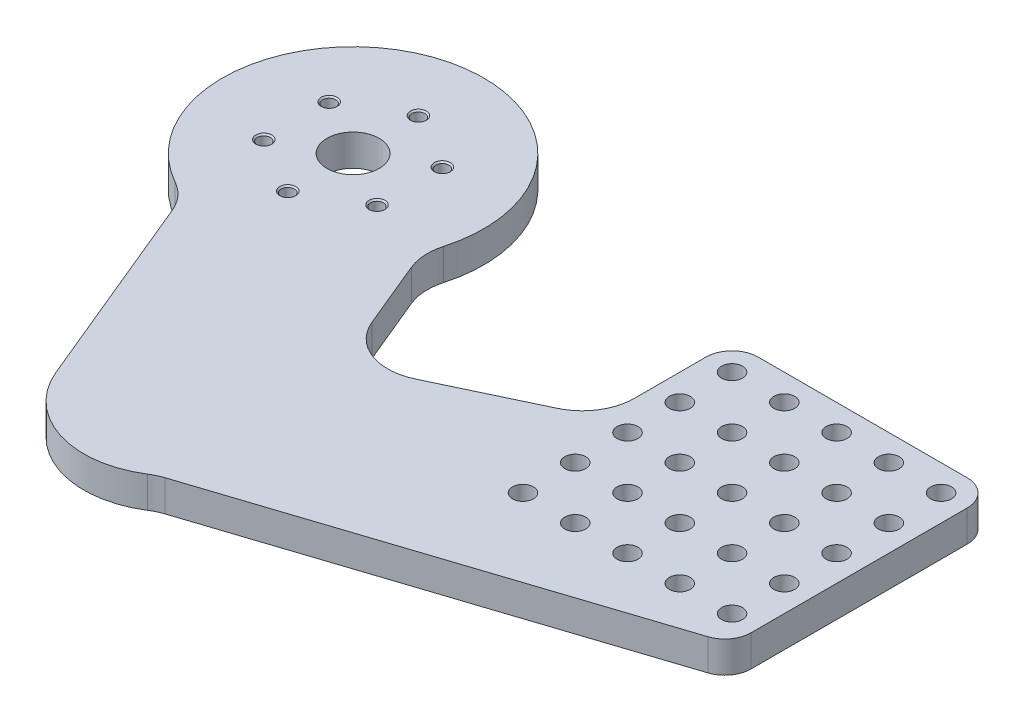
ISO-10303-21;
HEADER;
FILE_DESCRIPTION(('STEP AP214'),'2;1');
FILE_NAME('part.step','',(''),(''),'','','');
FILE_SCHEMA(('AUTOMOTIVE_DESIGN { 1 0 10303 214 1 1 1 1 }'));
ENDSEC;
DATA;
#1=APPLICATION_CONTEXT('core data for automotive mechanical design processes');
#2=APPLICATION_PROTOCOL_DEFINITION('international standard','automotive_design',2000,#1);
#3=PRODUCT_CONTEXT('',#1,'mechanical');
#4=PRODUCT('Part','Part','',(#3));
#5=PRODUCT_RELATED_PRODUCT_CATEGORY('part','',(#4));
#6=PRODUCT_DEFINITION_FORMATION('','',#4);
#7=PRODUCT_DEFINITION_CONTEXT('part definition',#1,'design');
#8=PRODUCT_DEFINITION('design','',#6,#7);
#9=PRODUCT_DEFINITION_SHAPE('','',#8);
#10=(LENGTH_UNIT() NAMED_UNIT(*) SI_UNIT(.MILLI.,.METRE.));
#11=(NAMED_UNIT(*) PLANE_ANGLE_UNIT() SI_UNIT($,.RADIAN.));
#12=(NAMED_UNIT(*) SI_UNIT($,.STERADIAN.) SOLID_ANGLE_UNIT());
#13=UNCERTAINTY_MEASURE_WITH_UNIT(LENGTH_MEASURE(1.E-05),#10,'distance_accuracy_value','');
#14=(GEOMETRIC_REPRESENTATION_CONTEXT(3) GLOBAL_UNCERTAINTY_ASSIGNED_CONTEXT((#13)) GLOBAL_UNIT_ASSIGNED_CONTEXT((#10,
#11,#12)) REPRESENTATION_CONTEXT('',''));
#15=CARTESIAN_POINT('',(0.,0.,0.));
#16=DIRECTION('',(0.,0.,1.));
#17=DIRECTION('',(1.,0.,0.));
#18=AXIS2_PLACEMENT_3D('',#15,#16,#17);
#19=CARTESIAN_POINT('',(-92.5,6.,-20.));
#20=DIRECTION('',(0.,-1.,0.));
#21=DIRECTION('',(0.,0.,-1.));
#22=AXIS2_PLACEMENT_3D('',#19,#20,#21);
#23=CYLINDRICAL_SURFACE('',#22,25.);
#24=CARTESIAN_POINT('',(-92.5,6.,-20.));
#25=DIRECTION('',(0.,1.,0.));
#26=DIRECTION('',(0.,0.,1.));
#27=AXIS2_PLACEMENT_3D('',#24,#25,#26);
#28=CIRCLE('',#27,25.);
#29=CARTESIAN_POINT('',(-68.4342667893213,6.,-13.2294398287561));
#30=VERTEX_POINT('',#29);
#31=CARTESIAN_POINT('',(-104.729534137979,6.,1.80455215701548));
#32=VERTEX_POINT('',#31);
#33=EDGE_CURVE('E183',#30,#32,#28,.T.);
#34=ORIENTED_EDGE('',*,*,#33,.F.);
#35=DIRECTION('',(0.,-1.,0.));
#36=VECTOR('',#35,1.);
#37=CARTESIAN_POINT('',(-68.4342667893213,6.,-13.2294398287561));
#38=LINE('',#37,#36);
#39=CARTESIAN_POINT('',(-68.4342667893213,0.,-13.2294398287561));
#40=VERTEX_POINT('',#39);
#41=EDGE_CURVE('E397',#30,#40,#38,.T.);
#42=ORIENTED_EDGE('',*,*,#41,.T.);
#43=CARTESIAN_POINT('',(-92.5,0.,-20.));
#44=DIRECTION('',(0.,1.,0.));
#45=DIRECTION('',(0.,0.,1.));
#46=AXIS2_PLACEMENT_3D('',#43,#44,#45);
#47=CIRCLE('',#46,25.);
#48=CARTESIAN_POINT('',(-104.729534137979,0.,1.80455215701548));
#49=VERTEX_POINT('',#48);
#50=EDGE_CURVE('E221',#40,#49,#47,.T.);
#51=ORIENTED_EDGE('',*,*,#50,.T.);
#52=DIRECTION('',(0.,-1.,0.));
#53=VECTOR('',#52,1.);
#54=CARTESIAN_POINT('',(-104.729534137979,6.,1.80455215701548));
#55=LINE('',#54,#53);
#56=EDGE_CURVE('E394',#49,#32,#55,.F.);
#57=ORIENTED_EDGE('',*,*,#56,.T.);
#58=EDGE_LOOP('',(#34,#42,#51,#57));
#59=FACE_BOUND('',#58,.T.);
#60=ADVANCED_FACE('F51',(#59),#23,.T.);
#61=CARTESIAN_POINT('',(-88.0505126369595,6.,36.4717165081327));
#62=DIRECTION('',(0.923879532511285,0.,-0.382683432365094));
#63=DIRECTION('',(-0.382683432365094,0.,-0.923879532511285));
#64=AXIS2_PLACEMENT_3D('',#61,#62,#63);
#65=PLANE('',#64);
#66=DIRECTION('',(0.382683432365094,0.,0.923879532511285));
#67=VECTOR('',#66,1.);
#68=CARTESIAN_POINT('',(-88.0505126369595,6.,36.4717165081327));
#69=LINE('',#68,#67);
#70=CARTESIAN_POINT('',(-100.382552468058,6.,6.69953869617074));
#71=VERTEX_POINT('',#70);
#72=CARTESIAN_POINT('',(-84.6199927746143,6.,44.7537240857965));
#73=VERTEX_POINT('',#72);
#74=EDGE_CURVE('E171',#71,#73,#69,.T.);
#75=ORIENTED_EDGE('',*,*,#74,.F.);
#76=DIRECTION('',(0.,1.,0.));
#77=VECTOR('',#76,1.);
#78=CARTESIAN_POINT('',(-100.382552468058,0.,6.69953869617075));
#79=LINE('',#78,#77);
#80=CARTESIAN_POINT('',(-100.382552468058,0.,6.69953869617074));
#81=VERTEX_POINT('',#80);
#82=EDGE_CURVE('E408',#71,#81,#79,.F.);
#83=ORIENTED_EDGE('',*,*,#82,.T.);
#84=DIRECTION('',(0.382683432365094,0.,0.923879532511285));
#85=VECTOR('',#84,1.);
#86=CARTESIAN_POINT('',(-88.0505126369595,0.,36.4717165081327));
#87=LINE('',#86,#85);
#88=CARTESIAN_POINT('',(-84.6199927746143,0.,44.7537240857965));
#89=VERTEX_POINT('',#88);
#90=EDGE_CURVE('E189',#81,#89,#87,.T.);
#91=ORIENTED_EDGE('',*,*,#90,.T.);
#92=DIRECTION('',(0.,-1.,0.));
#93=VECTOR('',#92,1.);
#94=CARTESIAN_POINT('',(-84.6199927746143,6.,44.7537240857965));
#95=LINE('',#94,#93);
#96=EDGE_CURVE('E186',#73,#89,#95,.T.);
#97=ORIENTED_EDGE('',*,*,#96,.F.);
#98=EDGE_LOOP('',(#75,#83,#91,#97));
#99=FACE_BOUND('',#98,.T.);
#100=ADVANCED_FACE('F187',(#99),#65,.F.);
#101=CARTESIAN_POINT('',(-68.4521009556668,6.,38.0567640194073));
#102=DIRECTION('',(0.,-1.,0.));
#103=DIRECTION('',(0.,0.,-1.));
#104=AXIS2_PLACEMENT_3D('',#101,#102,#103);
#105=CYLINDRICAL_SURFACE('',#104,17.5);
#106=CARTESIAN_POINT('',(-68.4521009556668,0.,38.0567640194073));
#107=DIRECTION('',(0.,1.,0.));
#108=DIRECTION('',(0.,0.,1.));
#109=AXIS2_PLACEMENT_3D('',#106,#107,#108);
#110=CIRCLE('',#109,17.5);
#111=CARTESIAN_POINT('',(-59.0419715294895,0.,52.8114061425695));
#112=VERTEX_POINT('',#111);
#113=EDGE_CURVE('E228',#89,#112,#110,.T.);
#114=ORIENTED_EDGE('',*,*,#113,.T.);
#115=DIRECTION('',(0.,-1.,0.));
#116=VECTOR('',#115,1.);
#117=CARTESIAN_POINT('',(-59.0419715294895,6.,52.8114061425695));
#118=LINE('',#117,#116);
#119=CARTESIAN_POINT('',(-59.0419715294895,6.,52.8114061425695));
#120=VERTEX_POINT('',#119);
#121=EDGE_CURVE('E68',#112,#120,#118,.F.);
#122=ORIENTED_EDGE('',*,*,#121,.T.);
#123=CARTESIAN_POINT('',(-68.4521009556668,6.,38.0567640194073));
#124=DIRECTION('',(0.,1.,0.));
#125=DIRECTION('',(0.,0.,1.));
#126=AXIS2_PLACEMENT_3D('',#123,#124,#125);
#127=CIRCLE('',#126,17.5);
#128=EDGE_CURVE('E174',#73,#120,#127,.T.);
#129=ORIENTED_EDGE('',*,*,#128,.F.);
#130=ORIENTED_EDGE('',*,*,#96,.T.);
#131=EDGE_LOOP('',(#114,#122,#129,#130));
#132=FACE_BOUND('',#131,.T.);
#133=ADVANCED_FACE('F194',(#132),#105,.T.);
#134=CARTESIAN_POINT('',(9.79958961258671,6.,29.9701970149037));
#135=DIRECTION('',(-0.310785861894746,0.,-0.950479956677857));
#136=DIRECTION('',(-0.950479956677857,0.,0.310785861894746));
#137=AXIS2_PLACEMENT_3D('',#134,#135,#136);
#138=PLANE('',#137);
#139=DIRECTION('',(0.950479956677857,0.,-0.310785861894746));
#140=VECTOR('',#139,1.);
#141=CARTESIAN_POINT('',(9.79958961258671,6.,29.9701970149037));
#142=LINE('',#141,#140);
#143=CARTESIAN_POINT('',(-56.7726133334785,6.,51.7378306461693));
#144=VERTEX_POINT('',#143);
#145=CARTESIAN_POINT('',(21.5539293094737,6.,26.1267886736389));
#146=VERTEX_POINT('',#145);
#147=EDGE_CURVE('E196',#144,#146,#142,.T.);
#148=ORIENTED_EDGE('',*,*,#147,.F.);
#149=DIRECTION('',(0.,1.,0.));
#150=VECTOR('',#149,1.);
#151=CARTESIAN_POINT('',(-56.7726133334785,0.,51.7378306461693));
#152=LINE('',#151,#150);
#153=CARTESIAN_POINT('',(-56.7726133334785,0.,51.7378306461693));
#154=VERTEX_POINT('',#153);
#155=EDGE_CURVE('E421',#144,#154,#152,.F.);
#156=ORIENTED_EDGE('',*,*,#155,.T.);
#157=DIRECTION('',(0.950479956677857,0.,-0.310785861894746));
#158=VECTOR('',#157,1.);
#159=CARTESIAN_POINT('',(9.79958961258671,0.,29.9701970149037));
#160=LINE('',#159,#158);
#161=CARTESIAN_POINT('',(21.5539293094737,0.,26.1267886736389));
#162=VERTEX_POINT('',#161);
#163=EDGE_CURVE('E231',#154,#162,#160,.T.);
#164=ORIENTED_EDGE('',*,*,#163,.T.);
#165=DIRECTION('',(0.,-1.,0.));
#166=VECTOR('',#165,1.);
#167=CARTESIAN_POINT('',(21.5539293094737,6.,26.1267886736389));
#168=LINE('',#167,#166);
#169=EDGE_CURVE('E370',#162,#146,#168,.F.);
#170=ORIENTED_EDGE('',*,*,#169,.T.);
#171=EDGE_LOOP('',(#148,#156,#164,#170));
#172=FACE_BOUND('',#171,.T.);
#173=ADVANCED_FACE('F501',(#172),#138,.F.);
#174=CARTESIAN_POINT('',(25.,6.,0.));
#175=DIRECTION('',(1.,0.,0.));
#176=DIRECTION('',(0.,0.,-1.));
#177=AXIS2_PLACEMENT_3D('',#174,#175,#176);
#178=PLANE('',#177);
#179=DIRECTION('',(0.,0.,1.));
#180=VECTOR('',#179,1.);
#181=CARTESIAN_POINT('',(25.,6.,0.));
#182=LINE('',#181,#180);
#183=CARTESIAN_POINT('',(25.,6.,-20.));
#184=VERTEX_POINT('',#183);
#185=CARTESIAN_POINT('',(25.,6.,21.3743888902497));
#186=VERTEX_POINT('',#185);
#187=EDGE_CURVE('E199',#184,#186,#182,.T.);
#188=ORIENTED_EDGE('',*,*,#187,.T.);
#189=DIRECTION('',(0.,-1.,0.));
#190=VECTOR('',#189,1.);
#191=CARTESIAN_POINT('',(25.,0.,21.3743888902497));
#192=LINE('',#191,#190);
#193=CARTESIAN_POINT('',(25.,0.,21.3743888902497));
#194=VERTEX_POINT('',#193);
#195=EDGE_CURVE('E356',#186,#194,#192,.T.);
#196=ORIENTED_EDGE('',*,*,#195,.T.);
#197=DIRECTION('',(0.,0.,1.));
#198=VECTOR('',#197,1.);
#199=CARTESIAN_POINT('',(25.,0.,0.));
#200=LINE('',#199,#198);
#201=CARTESIAN_POINT('',(25.,0.,-20.));
#202=VERTEX_POINT('',#201);
#203=EDGE_CURVE('E234',#202,#194,#200,.T.);
#204=ORIENTED_EDGE('',*,*,#203,.F.);
#205=DIRECTION('',(0.,-1.,0.));
#206=VECTOR('',#205,1.);
#207=CARTESIAN_POINT('',(25.,6.,-20.));
#208=LINE('',#207,#206);
#209=EDGE_CURVE('E191',#202,#184,#208,.F.);
#210=ORIENTED_EDGE('',*,*,#209,.T.);
#211=EDGE_LOOP('',(#188,#196,#204,#210));
#212=FACE_BOUND('',#211,.T.);
#213=ADVANCED_FACE('F492',(#212),#178,.T.);
#214=CARTESIAN_POINT('',(0.,6.,-25.));
#215=DIRECTION('',(0.,0.,-1.));
#216=DIRECTION('',(-1.,0.,0.));
#217=AXIS2_PLACEMENT_3D('',#214,#215,#216);
#218=PLANE('',#217);
#219=DIRECTION('',(1.,0.,0.));
#220=VECTOR('',#219,1.);
#221=CARTESIAN_POINT('',(0.,6.,-25.));
#222=LINE('',#221,#220);
#223=CARTESIAN_POINT('',(-20.,6.,-25.));
#224=VERTEX_POINT('',#223);
#225=CARTESIAN_POINT('',(20.,6.,-25.));
#226=VERTEX_POINT('',#225);
#227=EDGE_CURVE('E206',#224,#226,#222,.T.);
#228=ORIENTED_EDGE('',*,*,#227,.T.);
#229=DIRECTION('',(0.,-1.,0.));
#230=VECTOR('',#229,1.);
#231=CARTESIAN_POINT('',(20.,6.,-25.));
#232=LINE('',#231,#230);
#233=CARTESIAN_POINT('',(20.,0.,-25.));
#234=VERTEX_POINT('',#233);
#235=EDGE_CURVE('E386',#226,#234,#232,.T.);
#236=ORIENTED_EDGE('',*,*,#235,.T.);
#237=DIRECTION('',(1.,0.,0.));
#238=VECTOR('',#237,1.);
#239=CARTESIAN_POINT('',(0.,0.,-25.));
#240=LINE('',#239,#238);
#241=CARTESIAN_POINT('',(-20.,0.,-25.));
#242=VERTEX_POINT('',#241);
#243=EDGE_CURVE('E238',#242,#234,#240,.T.);
#244=ORIENTED_EDGE('',*,*,#243,.F.);
#245=DIRECTION('',(0.,-1.,0.));
#246=VECTOR('',#245,1.);
#247=CARTESIAN_POINT('',(-20.,6.,-25.));
#248=LINE('',#247,#246);
#249=EDGE_CURVE('E383',#242,#224,#248,.F.);
#250=ORIENTED_EDGE('',*,*,#249,.T.);
#251=EDGE_LOOP('',(#228,#236,#244,#250));
#252=FACE_BOUND('',#251,.T.);
#253=ADVANCED_FACE('F483',(#252),#218,.T.);
#254=CARTESIAN_POINT('',(-25.,6.,0.));
#255=DIRECTION('',(1.,0.,0.));
#256=DIRECTION('',(0.,0.,-1.));
#257=AXIS2_PLACEMENT_3D('',#254,#255,#256);
#258=PLANE('',#257);
#259=DIRECTION('',(0.,0.,1.));
#260=VECTOR('',#259,1.);
#261=CARTESIAN_POINT('',(-25.,0.,0.));
#262=LINE('',#261,#260);
#263=CARTESIAN_POINT('',(-25.,0.,-20.));
#264=VERTEX_POINT('',#263);
#265=CARTESIAN_POINT('',(-25.,0.,-6.33171211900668));
#266=VERTEX_POINT('',#265);
#267=EDGE_CURVE('E242',#264,#266,#262,.T.);
#268=ORIENTED_EDGE('',*,*,#267,.T.);
#269=DIRECTION('',(0.,-1.,0.));
#270=VECTOR('',#269,1.);
#271=CARTESIAN_POINT('',(-25.,6.,-6.33171211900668));
#272=LINE('',#271,#270);
#273=CARTESIAN_POINT('',(-25.,6.,-6.33171211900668));
#274=VERTEX_POINT('',#273);
#275=EDGE_CURVE('E418',#266,#274,#272,.F.);
#276=ORIENTED_EDGE('',*,*,#275,.T.);
#277=DIRECTION('',(0.,0.,1.));
#278=VECTOR('',#277,1.);
#279=CARTESIAN_POINT('',(-25.,6.,0.));
#280=LINE('',#279,#278);
#281=CARTESIAN_POINT('',(-25.,6.,-20.));
#282=VERTEX_POINT('',#281);
#283=EDGE_CURVE('E210',#282,#274,#280,.T.);
#284=ORIENTED_EDGE('',*,*,#283,.F.);
#285=DIRECTION('',(0.,-1.,0.));
#286=VECTOR('',#285,1.);
#287=CARTESIAN_POINT('',(-25.,0.,-20.));
#288=LINE('',#287,#286);
#289=EDGE_CURVE('E390',#282,#264,#288,.T.);
#290=ORIENTED_EDGE('',*,*,#289,.T.);
#291=EDGE_LOOP('',(#268,#276,#284,#290));
#292=FACE_BOUND('',#291,.T.);
#293=ADVANCED_FACE('F474',(#292),#258,.F.);
#294=CARTESIAN_POINT('',(-4.57206510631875,6.,-9.66425622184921));
#295=DIRECTION('',(-0.427647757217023,0.,-0.903945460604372));
#296=DIRECTION('',(-0.903945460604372,0.,0.427647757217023));
#297=AXIS2_PLACEMENT_3D('',#294,#295,#296);
#298=PLANE('',#297);
#299=DIRECTION('',(0.903945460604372,0.,-0.427647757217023));
#300=VECTOR('',#299,1.);
#301=CARTESIAN_POINT('',(-4.57206510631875,6.,-9.66425622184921));
#302=LINE('',#301,#300);
#303=CARTESIAN_POINT('',(-49.1795052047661,6.,11.4390874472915));
#304=VERTEX_POINT('',#303);
#305=CARTESIAN_POINT('',(-30.7235224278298,6.,2.70774248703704));
#306=VERTEX_POINT('',#305);
#307=EDGE_CURVE('E214',#304,#306,#302,.T.);
#308=ORIENTED_EDGE('',*,*,#307,.T.);
#309=DIRECTION('',(0.,-1.,0.));
#310=VECTOR('',#309,1.);
#311=CARTESIAN_POINT('',(-30.7235224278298,6.,2.70774248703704));
#312=LINE('',#311,#310);
#313=CARTESIAN_POINT('',(-30.7235224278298,0.,2.70774248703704));
#314=VERTEX_POINT('',#313);
#315=EDGE_CURVE('E414',#306,#314,#312,.T.);
#316=ORIENTED_EDGE('',*,*,#315,.T.);
#317=DIRECTION('',(0.903945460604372,0.,-0.427647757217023));
#318=VECTOR('',#317,1.);
#319=CARTESIAN_POINT('',(-4.57206510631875,0.,-9.66425622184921));
#320=LINE('',#319,#318);
#321=CARTESIAN_POINT('',(-49.1795052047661,0.,11.4390874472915));
#322=VERTEX_POINT('',#321);
#323=EDGE_CURVE('E246',#322,#314,#320,.T.);
#324=ORIENTED_EDGE('',*,*,#323,.F.);
#325=DIRECTION('',(0.,-1.,0.));
#326=VECTOR('',#325,1.);
#327=CARTESIAN_POINT('',(-49.1795052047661,6.,11.4390874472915));
#328=LINE('',#327,#326);
#329=EDGE_CURVE('E411',#322,#304,#328,.F.);
#330=ORIENTED_EDGE('',*,*,#329,.T.);
#331=EDGE_LOOP('',(#308,#316,#324,#330));
#332=FACE_BOUND('',#331,.T.);
#333=ADVANCED_FACE('F466',(#332),#298,.T.);
#334=CARTESIAN_POINT('',(-55.7147289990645,6.,23.0777963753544));
#335=DIRECTION('',(0.923879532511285,0.,-0.382683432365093));
#336=DIRECTION('',(-0.382683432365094,0.,-0.923879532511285));
#337=AXIS2_PLACEMENT_3D('',#334,#335,#336);
#338=PLANE('',#337);
#339=DIRECTION('',(0.382683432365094,0.,0.923879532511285));
#340=VECTOR('',#339,1.);
#341=CARTESIAN_POINT('',(-55.7147289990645,0.,23.0777963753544));
#342=LINE('',#341,#340);
#343=CARTESIAN_POINT('',(-68.0467688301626,0.,-6.69438143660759));
#344=VERTEX_POINT('',#343);
#345=CARTESIAN_POINT('',(-62.6947781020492,0.,6.22646716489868));
#346=VERTEX_POINT('',#345);
#347=EDGE_CURVE('E250',#344,#346,#342,.T.);
#348=ORIENTED_EDGE('',*,*,#347,.F.);
#349=DIRECTION('',(0.,-1.,0.));
#350=VECTOR('',#349,1.);
#351=CARTESIAN_POINT('',(-68.0467688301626,6.,-6.69438143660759));
#352=LINE('',#351,#350);
#353=CARTESIAN_POINT('',(-68.0467688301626,6.,-6.69438143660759));
#354=VERTEX_POINT('',#353);
#355=EDGE_CURVE('E405',#344,#354,#352,.F.);
#356=ORIENTED_EDGE('',*,*,#355,.T.);
#357=DIRECTION('',(0.382683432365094,0.,0.923879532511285));
#358=VECTOR('',#357,1.);
#359=CARTESIAN_POINT('',(-55.7147289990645,6.,23.0777963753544));
#360=LINE('',#359,#358);
#361=CARTESIAN_POINT('',(-62.6947781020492,6.,6.22646716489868));
#362=VERTEX_POINT('',#361);
#363=EDGE_CURVE('E192',#354,#362,#360,.T.);
#364=ORIENTED_EDGE('',*,*,#363,.T.);
#365=DIRECTION('',(0.,-1.,0.));
#366=VECTOR('',#365,1.);
#367=CARTESIAN_POINT('',(-62.6947781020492,0.,6.22646716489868));
#368=LINE('',#367,#366);
#369=EDGE_CURVE('E401',#362,#346,#368,.T.);
#370=ORIENTED_EDGE('',*,*,#369,.T.);
#371=EDGE_LOOP('',(#348,#356,#364,#370));
#372=FACE_BOUND('',#371,.T.);
#373=ADVANCED_FACE('F460',(#372),#338,.T.);
#374=CARTESIAN_POINT('',(0.,6.,0.));
#375=DIRECTION('',(0.,1.,0.));
#376=DIRECTION('',(0.,0.,1.));
#377=AXIS2_PLACEMENT_3D('',#374,#375,#376);
#378=PLANE('',#377);
#379=CARTESIAN_POINT('',(-92.5,6.,-20.));
#380=DIRECTION('',(0.,1.,0.));
#381=DIRECTION('',(0.,0.,1.));
#382=AXIS2_PLACEMENT_3D('',#379,#380,#381);
#383=CIRCLE('',#382,5.);
#384=CARTESIAN_POINT('',(-92.5,6.,-15.));
#385=VERTEX_POINT('',#384);
#386=EDGE_CURVE('E1415',#385,#385,#383,.T.);
#387=ORIENTED_EDGE('',*,*,#386,.F.);
#388=EDGE_LOOP('',(#387));
#389=FACE_BOUND('',#388,.T.);
#390=CARTESIAN_POINT('',(-92.5,6.,-32.5));
#391=DIRECTION('',(0.,1.,0.));
#392=DIRECTION('',(0.,0.,1.));
#393=AXIS2_PLACEMENT_3D('',#390,#391,#392);
#394=CIRCLE('',#393,1.525);
#395=CARTESIAN_POINT('',(-92.5,6.,-30.975));
#396=VERTEX_POINT('',#395);
#397=EDGE_CURVE('E1411',#396,#396,#394,.T.);
#398=ORIENTED_EDGE('',*,*,#397,.F.);
#399=EDGE_LOOP('',(#398));
#400=FACE_BOUND('',#399,.T.);
#401=CARTESIAN_POINT('',(-81.6746824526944,6.,-26.2500000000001));
#402=DIRECTION('',(0.,1.,0.));
#403=DIRECTION('',(0.,0.,1.));
#404=AXIS2_PLACEMENT_3D('',#401,#402,#403);
#405=CIRCLE('',#404,1.525);
#406=CARTESIAN_POINT('',(-81.6746824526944,6.,-24.7250000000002));
#407=VERTEX_POINT('',#406);
#408=EDGE_CURVE('E1399',#407,#407,#405,.T.);
#409=ORIENTED_EDGE('',*,*,#408,.F.);
#410=EDGE_LOOP('',(#409));
#411=FACE_BOUND('',#410,.T.);
#412=CARTESIAN_POINT('',(-81.6746824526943,6.,-13.7500000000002));
#413=DIRECTION('',(0.,1.,0.));
#414=DIRECTION('',(0.,0.,1.));
#415=AXIS2_PLACEMENT_3D('',#412,#413,#414);
#416=CIRCLE('',#415,1.525);
#417=CARTESIAN_POINT('',(-81.6746824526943,6.,-12.2250000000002));
#418=VERTEX_POINT('',#417);
#419=EDGE_CURVE('E1387',#418,#418,#416,.T.);
#420=ORIENTED_EDGE('',*,*,#419,.F.);
#421=EDGE_LOOP('',(#420));
#422=FACE_BOUND('',#421,.T.);
#423=CARTESIAN_POINT('',(-92.4999999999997,6.,-7.50000000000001));
#424=DIRECTION('',(0.,1.,0.));
#425=DIRECTION('',(0.,0.,1.));
#426=AXIS2_PLACEMENT_3D('',#423,#424,#425);
#427=CIRCLE('',#426,1.525);
#428=CARTESIAN_POINT('',(-92.4999999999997,6.,-5.97500000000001));
#429=VERTEX_POINT('',#428);
#430=EDGE_CURVE('E1375',#429,#429,#427,.T.);
#431=ORIENTED_EDGE('',*,*,#430,.F.);
#432=EDGE_LOOP('',(#431));
#433=FACE_BOUND('',#432,.T.);
#434=CARTESIAN_POINT('',(-103.325317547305,6.,-13.75));
#435=DIRECTION('',(0.,1.,0.));
#436=DIRECTION('',(0.,0.,1.));
#437=AXIS2_PLACEMENT_3D('',#434,#435,#436);
#438=CIRCLE('',#437,1.525);
#439=CARTESIAN_POINT('',(-103.325317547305,6.,-12.225));
#440=VERTEX_POINT('',#439);
#441=EDGE_CURVE('E1363',#440,#440,#438,.T.);
#442=ORIENTED_EDGE('',*,*,#441,.F.);
#443=EDGE_LOOP('',(#442));
#444=FACE_BOUND('',#443,.T.);
#445=CARTESIAN_POINT('',(-103.325317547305,6.,-26.25));
#446=DIRECTION('',(0.,1.,0.));
#447=DIRECTION('',(0.,0.,1.));
#448=AXIS2_PLACEMENT_3D('',#445,#446,#447);
#449=CIRCLE('',#448,1.525);
#450=CARTESIAN_POINT('',(-103.325317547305,6.,-24.725));
#451=VERTEX_POINT('',#450);
#452=EDGE_CURVE('E1351',#451,#451,#449,.T.);
#453=ORIENTED_EDGE('',*,*,#452,.F.);
#454=EDGE_LOOP('',(#453));
#455=FACE_BOUND('',#454,.T.);
#456=CARTESIAN_POINT('',(0.,6.,10.));
#457=DIRECTION('',(0.,1.,0.));
#458=DIRECTION('',(0.,0.,1.));
#459=AXIS2_PLACEMENT_3D('',#456,#457,#458);
#460=CIRCLE('',#459,2.);
#461=CARTESIAN_POINT('',(0.,6.,12.));
#462=VERTEX_POINT('',#461);
#463=EDGE_CURVE('E1123',#462,#462,#460,.T.);
#464=ORIENTED_EDGE('',*,*,#463,.F.);
#465=EDGE_LOOP('',(#464));
#466=FACE_BOUND('',#465,.T.);
#467=CARTESIAN_POINT('',(-10.,6.,10.));
#468=DIRECTION('',(0.,1.,0.));
#469=DIRECTION('',(0.,0.,1.));
#470=AXIS2_PLACEMENT_3D('',#467,#468,#469);
#471=CIRCLE('',#470,2.);
#472=CARTESIAN_POINT('',(-10.,6.,12.));
#473=VERTEX_POINT('',#472);
#474=EDGE_CURVE('E1201',#473,#473,#471,.T.);
#475=ORIENTED_EDGE('',*,*,#474,.F.);
#476=EDGE_LOOP('',(#475));
#477=FACE_BOUND('',#476,.T.);
#478=CARTESIAN_POINT('',(-20.,6.,10.));
#479=DIRECTION('',(0.,1.,0.));
#480=DIRECTION('',(0.,0.,1.));
#481=AXIS2_PLACEMENT_3D('',#478,#479,#480);
#482=CIRCLE('',#481,2.);
#483=CARTESIAN_POINT('',(-20.,6.,12.));
#484=VERTEX_POINT('',#483);
#485=EDGE_CURVE('E1209',#484,#484,#482,.T.);
#486=ORIENTED_EDGE('',*,*,#485,.F.);
#487=EDGE_LOOP('',(#486));
#488=FACE_BOUND('',#487,.T.);
#489=CARTESIAN_POINT('',(-20.0000000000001,6.,0.));
#490=DIRECTION('',(0.,1.,0.));
#491=DIRECTION('',(0.,0.,1.));
#492=AXIS2_PLACEMENT_3D('',#489,#490,#491);
#493=CIRCLE('',#492,2.);
#494=CARTESIAN_POINT('',(-20.0000000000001,6.,2.00000000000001));
#495=VERTEX_POINT('',#494);
#496=EDGE_CURVE('E1218',#495,#495,#493,.T.);
#497=ORIENTED_EDGE('',*,*,#496,.F.);
#498=EDGE_LOOP('',(#497));
#499=FACE_BOUND('',#498,.T.);
#500=CARTESIAN_POINT('',(-20.0000000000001,6.,-9.99999999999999));
#501=DIRECTION('',(0.,1.,0.));
#502=DIRECTION('',(0.,0.,1.));
#503=AXIS2_PLACEMENT_3D('',#500,#501,#502);
#504=CIRCLE('',#503,2.);
#505=CARTESIAN_POINT('',(-20.0000000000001,6.,-7.99999999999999));
#506=VERTEX_POINT('',#505);
#507=EDGE_CURVE('E1222',#506,#506,#504,.T.);
#508=ORIENTED_EDGE('',*,*,#507,.F.);
#509=EDGE_LOOP('',(#508));
#510=FACE_BOUND('',#509,.T.);
#511=CARTESIAN_POINT('',(-10.0000000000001,6.,-9.99999999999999));
#512=DIRECTION('',(0.,1.,0.));
#513=DIRECTION('',(0.,0.,1.));
#514=AXIS2_PLACEMENT_3D('',#511,#512,#513);
#515=CIRCLE('',#514,2.);
#516=CARTESIAN_POINT('',(-10.0000000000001,6.,-7.99999999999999));
#517=VERTEX_POINT('',#516);
#518=EDGE_CURVE('E1315',#517,#517,#515,.T.);
#519=ORIENTED_EDGE('',*,*,#518,.F.);
#520=EDGE_LOOP('',(#519));
#521=FACE_BOUND('',#520,.T.);
#522=CARTESIAN_POINT('',(-10.0000000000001,6.,0.));
#523=DIRECTION('',(0.,1.,0.));
#524=DIRECTION('',(0.,0.,1.));
#525=AXIS2_PLACEMENT_3D('',#522,#523,#524);
#526=CIRCLE('',#525,2.);
#527=CARTESIAN_POINT('',(-10.0000000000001,6.,2.));
#528=VERTEX_POINT('',#527);
#529=EDGE_CURVE('E1318',#528,#528,#526,.T.);
#530=ORIENTED_EDGE('',*,*,#529,.F.);
#531=EDGE_LOOP('',(#530));
#532=FACE_BOUND('',#531,.T.);
#533=CARTESIAN_POINT('',(0.,6.,0.));
#534=DIRECTION('',(0.,1.,0.));
#535=DIRECTION('',(0.,0.,1.));
#536=AXIS2_PLACEMENT_3D('',#533,#534,#535);
#537=CIRCLE('',#536,2.);
#538=CARTESIAN_POINT('',(0.,6.,2.));
#539=VERTEX_POINT('',#538);
#540=EDGE_CURVE('E1212',#539,#539,#537,.T.);
#541=ORIENTED_EDGE('',*,*,#540,.F.);
#542=EDGE_LOOP('',(#541));
#543=FACE_BOUND('',#542,.T.);
#544=CARTESIAN_POINT('',(-20.,6.,20.));
#545=DIRECTION('',(0.,1.,0.));
#546=DIRECTION('',(0.,0.,1.));
#547=AXIS2_PLACEMENT_3D('',#544,#545,#546);
#548=CIRCLE('',#547,2.);
#549=CARTESIAN_POINT('',(-20.,6.,22.));
#550=VERTEX_POINT('',#549);
#551=EDGE_CURVE('E1235',#550,#550,#548,.T.);
#552=ORIENTED_EDGE('',*,*,#551,.F.);
#553=EDGE_LOOP('',(#552));
#554=FACE_BOUND('',#553,.T.);
#555=CARTESIAN_POINT('',(-20.0000000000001,6.,-20.));
#556=DIRECTION('',(0.,1.,0.));
#557=DIRECTION('',(0.,0.,1.));
#558=AXIS2_PLACEMENT_3D('',#555,#556,#557);
#559=CIRCLE('',#558,2.);
#560=CARTESIAN_POINT('',(-20.0000000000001,6.,-18.));
#561=VERTEX_POINT('',#560);
#562=EDGE_CURVE('E1239',#561,#561,#559,.T.);
#563=ORIENTED_EDGE('',*,*,#562,.F.);
#564=EDGE_LOOP('',(#563));
#565=FACE_BOUND('',#564,.T.);
#566=CARTESIAN_POINT('',(19.9999999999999,6.,-20.));
#567=DIRECTION('',(0.,1.,0.));
#568=DIRECTION('',(0.,0.,1.));
#569=AXIS2_PLACEMENT_3D('',#566,#567,#568);
#570=CIRCLE('',#569,2.);
#571=CARTESIAN_POINT('',(19.9999999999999,6.,-18.));
#572=VERTEX_POINT('',#571);
#573=EDGE_CURVE('E1243',#572,#572,#570,.T.);
#574=ORIENTED_EDGE('',*,*,#573,.F.);
#575=EDGE_LOOP('',(#574));
#576=FACE_BOUND('',#575,.T.);
#577=CARTESIAN_POINT('',(-10.,6.,20.));
#578=DIRECTION('',(0.,1.,0.));
#579=DIRECTION('',(0.,0.,1.));
#580=AXIS2_PLACEMENT_3D('',#577,#578,#579);
#581=CIRCLE('',#580,2.);
#582=CARTESIAN_POINT('',(-10.,6.,22.));
#583=VERTEX_POINT('',#582);
#584=EDGE_CURVE('E1227',#583,#583,#581,.T.);
#585=ORIENTED_EDGE('',*,*,#584,.F.);
#586=EDGE_LOOP('',(#585));
#587=FACE_BOUND('',#586,.T.);
#588=CARTESIAN_POINT('',(0.,6.,20.));
#589=DIRECTION('',(0.,1.,0.));
#590=DIRECTION('',(0.,0.,1.));
#591=AXIS2_PLACEMENT_3D('',#588,#589,#590);
#592=CIRCLE('',#591,2.);
#593=CARTESIAN_POINT('',(0.,6.,22.));
#594=VERTEX_POINT('',#593);
#595=EDGE_CURVE('E1223',#594,#594,#592,.T.);
#596=ORIENTED_EDGE('',*,*,#595,.F.);
#597=EDGE_LOOP('',(#596));
#598=FACE_BOUND('',#597,.T.);
#599=CARTESIAN_POINT('',(10.,6.,20.));
#600=DIRECTION('',(0.,1.,0.));
#601=DIRECTION('',(0.,0.,1.));
#602=AXIS2_PLACEMENT_3D('',#599,#600,#601);
#603=CIRCLE('',#602,2.);
#604=CARTESIAN_POINT('',(10.,6.,22.));
#605=VERTEX_POINT('',#604);
#606=EDGE_CURVE('E1228',#605,#605,#603,.T.);
#607=ORIENTED_EDGE('',*,*,#606,.F.);
#608=EDGE_LOOP('',(#607));
#609=FACE_BOUND('',#608,.T.);
#610=CARTESIAN_POINT('',(20.,6.,10.));
#611=DIRECTION('',(0.,1.,0.));
#612=DIRECTION('',(0.,0.,1.));
#613=AXIS2_PLACEMENT_3D('',#610,#611,#612);
#614=CIRCLE('',#613,2.);
#615=CARTESIAN_POINT('',(20.,6.,12.));
#616=VERTEX_POINT('',#615);
#617=EDGE_CURVE('E1206',#616,#616,#614,.T.);
#618=ORIENTED_EDGE('',*,*,#617,.F.);
#619=EDGE_LOOP('',(#618));
#620=FACE_BOUND('',#619,.T.);
#621=CARTESIAN_POINT('',(9.99999999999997,6.,10.));
#622=DIRECTION('',(0.,1.,0.));
#623=DIRECTION('',(0.,0.,1.));
#624=AXIS2_PLACEMENT_3D('',#621,#622,#623);
#625=CIRCLE('',#624,2.);
#626=CARTESIAN_POINT('',(9.99999999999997,6.,12.));
#627=VERTEX_POINT('',#626);
#628=EDGE_CURVE('E1200',#627,#627,#625,.T.);
#629=ORIENTED_EDGE('',*,*,#628,.F.);
#630=EDGE_LOOP('',(#629));
#631=FACE_BOUND('',#630,.T.);
#632=CARTESIAN_POINT('',(19.9999999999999,6.,-9.99999999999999));
#633=DIRECTION('',(0.,1.,0.));
#634=DIRECTION('',(0.,0.,1.));
#635=AXIS2_PLACEMENT_3D('',#632,#633,#634);
#636=CIRCLE('',#635,2.);
#637=CARTESIAN_POINT('',(19.9999999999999,6.,-7.99999999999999));
#638=VERTEX_POINT('',#637);
#639=EDGE_CURVE('E1272',#638,#638,#636,.T.);
#640=ORIENTED_EDGE('',*,*,#639,.F.);
#641=EDGE_LOOP('',(#640));
#642=FACE_BOUND('',#641,.T.);
#643=CARTESIAN_POINT('',(19.9999999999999,6.,0.));
#644=DIRECTION('',(0.,1.,0.));
#645=DIRECTION('',(0.,0.,1.));
#646=AXIS2_PLACEMENT_3D('',#643,#644,#645);
#647=CIRCLE('',#646,2.);
#648=CARTESIAN_POINT('',(19.9999999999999,6.,2.00000000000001));
#649=VERTEX_POINT('',#648);
#650=EDGE_CURVE('E1276',#649,#649,#647,.T.);
#651=ORIENTED_EDGE('',*,*,#650,.F.);
#652=EDGE_LOOP('',(#651));
#653=FACE_BOUND('',#652,.T.);
#654=CARTESIAN_POINT('',(9.99999999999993,6.,0.));
#655=DIRECTION('',(0.,1.,0.));
#656=DIRECTION('',(0.,0.,1.));
#657=AXIS2_PLACEMENT_3D('',#654,#655,#656);
#658=CIRCLE('',#657,2.);
#659=CARTESIAN_POINT('',(9.99999999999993,6.,2.));
#660=VERTEX_POINT('',#659);
#661=EDGE_CURVE('E1280',#660,#660,#658,.T.);
#662=ORIENTED_EDGE('',*,*,#661,.F.);
#663=EDGE_LOOP('',(#662));
#664=FACE_BOUND('',#663,.T.);
#665=CARTESIAN_POINT('',(9.9999999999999,6.,-9.99999999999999));
#666=DIRECTION('',(0.,1.,0.));
#667=DIRECTION('',(0.,0.,1.));
#668=AXIS2_PLACEMENT_3D('',#665,#666,#667);
#669=CIRCLE('',#668,2.);
#670=CARTESIAN_POINT('',(9.9999999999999,6.,-7.99999999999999));
#671=VERTEX_POINT('',#670);
#672=EDGE_CURVE('E1284',#671,#671,#669,.T.);
#673=ORIENTED_EDGE('',*,*,#672,.F.);
#674=EDGE_LOOP('',(#673));
#675=FACE_BOUND('',#674,.T.);
#676=CARTESIAN_POINT('',(-1.00613961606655E-13,6.,-9.99999999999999));
#677=DIRECTION('',(0.,1.,0.));
#678=DIRECTION('',(0.,0.,1.));
#679=AXIS2_PLACEMENT_3D('',#676,#677,#678);
#680=CIRCLE('',#679,2.);
#681=CARTESIAN_POINT('',(-1.00613961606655E-13,6.,-7.99999999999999));
#682=VERTEX_POINT('',#681);
#683=EDGE_CURVE('E1288',#682,#682,#680,.T.);
#684=ORIENTED_EDGE('',*,*,#683,.F.);
#685=EDGE_LOOP('',(#684));
#686=FACE_BOUND('',#685,.T.);
#687=CARTESIAN_POINT('',(-1.35308431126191E-13,6.,-20.));
#688=DIRECTION('',(0.,1.,0.));
#689=DIRECTION('',(0.,0.,1.));
#690=AXIS2_PLACEMENT_3D('',#687,#688,#689);
#691=CIRCLE('',#690,2.);
#692=CARTESIAN_POINT('',(-1.35308431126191E-13,6.,-18.));
#693=VERTEX_POINT('',#692);
#694=EDGE_CURVE('E1292',#693,#693,#691,.T.);
#695=ORIENTED_EDGE('',*,*,#694,.F.);
#696=EDGE_LOOP('',(#695));
#697=FACE_BOUND('',#696,.T.);
#698=CARTESIAN_POINT('',(-10.0000000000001,6.,-20.));
#699=DIRECTION('',(0.,1.,0.));
#700=DIRECTION('',(0.,0.,1.));
#701=AXIS2_PLACEMENT_3D('',#698,#699,#700);
#702=CIRCLE('',#701,2.);
#703=CARTESIAN_POINT('',(-10.0000000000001,6.,-18.));
#704=VERTEX_POINT('',#703);
#705=EDGE_CURVE('E1296',#704,#704,#702,.T.);
#706=ORIENTED_EDGE('',*,*,#705,.F.);
#707=EDGE_LOOP('',(#706));
#708=FACE_BOUND('',#707,.T.);
#709=CARTESIAN_POINT('',(9.99999999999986,6.,-20.));
#710=DIRECTION('',(0.,1.,0.));
#711=DIRECTION('',(0.,0.,1.));
#712=AXIS2_PLACEMENT_3D('',#709,#710,#711);
#713=CIRCLE('',#712,2.);
#714=CARTESIAN_POINT('',(9.99999999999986,6.,-18.));
#715=VERTEX_POINT('',#714);
#716=EDGE_CURVE('E1299',#715,#715,#713,.T.);
#717=ORIENTED_EDGE('',*,*,#716,.F.);
#718=EDGE_LOOP('',(#717));
#719=FACE_BOUND('',#718,.T.);
#720=CARTESIAN_POINT('',(20.,6.,20.));
#721=DIRECTION('',(0.,1.,0.));
#722=DIRECTION('',(0.,0.,1.));
#723=AXIS2_PLACEMENT_3D('',#720,#721,#722);
#724=CIRCLE('',#723,2.);
#725=CARTESIAN_POINT('',(20.,6.,22.));
#726=VERTEX_POINT('',#725);
#727=EDGE_CURVE('E259',#726,#726,#724,.T.);
#728=ORIENTED_EDGE('',*,*,#727,.F.);
#729=EDGE_LOOP('',(#728));
#730=FACE_BOUND('',#729,.T.);
#731=ORIENTED_EDGE('',*,*,#128,.T.);
#732=CARTESIAN_POINT('',(-53.664754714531,6.,61.2426302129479));
#733=DIRECTION('',(0.,1.,0.));
#734=DIRECTION('',(0.,0.,1.));
#735=AXIS2_PLACEMENT_3D('',#732,#733,#734);
#736=CIRCLE('',#735,10.);
#737=EDGE_CURVE('E11',#120,#144,#736,.F.);
#738=ORIENTED_EDGE('',*,*,#737,.T.);
#739=ORIENTED_EDGE('',*,*,#147,.T.);
#740=CARTESIAN_POINT('',(20.,6.,21.3743888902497));
#741=DIRECTION('',(0.,1.,0.));
#742=DIRECTION('',(0.,0.,1.));
#743=AXIS2_PLACEMENT_3D('',#740,#741,#742);
#744=CIRCLE('',#743,5.);
#745=EDGE_CURVE('E380',#146,#186,#744,.T.);
#746=ORIENTED_EDGE('',*,*,#745,.T.);
#747=ORIENTED_EDGE('',*,*,#187,.F.);
#748=CARTESIAN_POINT('',(20.,6.,-20.));
#749=DIRECTION('',(0.,1.,0.));
#750=DIRECTION('',(0.,0.,1.));
#751=AXIS2_PLACEMENT_3D('',#748,#749,#750);
#752=CIRCLE('',#751,5.);
#753=EDGE_CURVE('E377',#184,#226,#752,.T.);
#754=ORIENTED_EDGE('',*,*,#753,.T.);
#755=ORIENTED_EDGE('',*,*,#227,.F.);
#756=CARTESIAN_POINT('',(-20.,6.,-20.));
#757=DIRECTION('',(0.,1.,0.));
#758=DIRECTION('',(0.,0.,1.));
#759=AXIS2_PLACEMENT_3D('',#756,#757,#758);
#760=CIRCLE('',#759,5.);
#761=EDGE_CURVE('E374',#224,#282,#760,.T.);
#762=ORIENTED_EDGE('',*,*,#761,.T.);
#763=ORIENTED_EDGE('',*,*,#283,.T.);
#764=CARTESIAN_POINT('',(-35.,6.,-6.33171211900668));
#765=DIRECTION('',(0.,1.,0.));
#766=DIRECTION('',(0.,0.,1.));
#767=AXIS2_PLACEMENT_3D('',#764,#765,#766);
#768=CIRCLE('',#767,10.);
#769=EDGE_CURVE('E441',#274,#306,#768,.F.);
#770=ORIENTED_EDGE('',*,*,#769,.T.);
#771=ORIENTED_EDGE('',*,*,#307,.F.);
#772=CARTESIAN_POINT('',(-53.4559827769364,6.,2.39963284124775));
#773=DIRECTION('',(0.,1.,0.));
#774=DIRECTION('',(0.,0.,1.));
#775=AXIS2_PLACEMENT_3D('',#772,#773,#774);
#776=CIRCLE('',#775,10.);
#777=EDGE_CURVE('E447',#304,#362,#776,.F.);
#778=ORIENTED_EDGE('',*,*,#777,.T.);
#779=ORIENTED_EDGE('',*,*,#363,.F.);
#780=CARTESIAN_POINT('',(-58.8079735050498,6.,-10.5212157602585));
#781=DIRECTION('',(0.,1.,0.));
#782=DIRECTION('',(0.,0.,1.));
#783=AXIS2_PLACEMENT_3D('',#780,#781,#782);
#784=CIRCLE('',#783,10.);
#785=EDGE_CURVE('E430',#354,#30,#784,.F.);
#786=ORIENTED_EDGE('',*,*,#785,.T.);
#787=ORIENTED_EDGE('',*,*,#33,.T.);
#788=CARTESIAN_POINT('',(-109.62134779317,6.,10.5263730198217));
#789=DIRECTION('',(0.,1.,0.));
#790=DIRECTION('',(0.,0.,1.));
#791=AXIS2_PLACEMENT_3D('',#788,#789,#790);
#792=CIRCLE('',#791,10.);
#793=EDGE_CURVE('E178',#32,#71,#792,.F.);
#794=ORIENTED_EDGE('',*,*,#793,.T.);
#795=ORIENTED_EDGE('',*,*,#74,.T.);
#796=EDGE_LOOP('',(#731,#738,#739,#746,#747,#754,#755,#762,#763,#770,#771,#778,#779,#786,#787,
#794,#795));
#797=FACE_BOUND('',#796,.T.);
#798=ADVANCED_FACE('F173',(#389,#400,#411,#422,#433,#444,#455,#466,#477,#488,#499,#510,#521,
#532,#543,#554,#565,#576,#587,#598,#609,#620,#631,#642,#653,#664,#675,#686,#697,#708,#719,#730,
#797),#378,.T.);
#799=CARTESIAN_POINT('',(0.,0.,0.));
#800=DIRECTION('',(0.,1.,0.));
#801=DIRECTION('',(0.,0.,1.));
#802=AXIS2_PLACEMENT_3D('',#799,#800,#801);
#803=PLANE('',#802);
#804=CARTESIAN_POINT('',(-92.5,0.,-20.));
#805=DIRECTION('',(0.,1.,0.));
#806=DIRECTION('',(0.,0.,1.));
#807=AXIS2_PLACEMENT_3D('',#804,#805,#806);
#808=CIRCLE('',#807,5.);
#809=CARTESIAN_POINT('',(-92.5,0.,-15.));
#810=VERTEX_POINT('',#809);
#811=EDGE_CURVE('E55',#810,#810,#808,.T.);
#812=ORIENTED_EDGE('',*,*,#811,.T.);
#813=EDGE_LOOP('',(#812));
#814=FACE_BOUND('',#813,.T.);
#815=CARTESIAN_POINT('',(-92.5,0.,-32.5));
#816=DIRECTION('',(0.,1.,0.));
#817=DIRECTION('',(0.,0.,1.));
#818=AXIS2_PLACEMENT_3D('',#815,#816,#817);
#819=CIRCLE('',#818,1.25);
#820=CARTESIAN_POINT('',(-92.5,0.,-31.25));
#821=VERTEX_POINT('',#820);
#822=EDGE_CURVE('E1403',#821,#821,#819,.T.);
#823=ORIENTED_EDGE('',*,*,#822,.T.);
#824=EDGE_LOOP('',(#823));
#825=FACE_BOUND('',#824,.T.);
#826=CARTESIAN_POINT('',(-81.6746824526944,0.,-26.2500000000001));
#827=DIRECTION('',(0.,1.,0.));
#828=DIRECTION('',(0.,0.,1.));
#829=AXIS2_PLACEMENT_3D('',#826,#827,#828);
#830=CIRCLE('',#829,1.25);
#831=CARTESIAN_POINT('',(-81.6746824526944,0.,-25.0000000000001));
#832=VERTEX_POINT('',#831);
#833=EDGE_CURVE('E1391',#832,#832,#830,.T.);
#834=ORIENTED_EDGE('',*,*,#833,.T.);
#835=EDGE_LOOP('',(#834));
#836=FACE_BOUND('',#835,.T.);
#837=CARTESIAN_POINT('',(-81.6746824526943,0.,-13.7500000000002));
#838=DIRECTION('',(0.,1.,0.));
#839=DIRECTION('',(0.,0.,1.));
#840=AXIS2_PLACEMENT_3D('',#837,#838,#839);
#841=CIRCLE('',#840,1.25);
#842=CARTESIAN_POINT('',(-81.6746824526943,0.,-12.5000000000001));
#843=VERTEX_POINT('',#842);
#844=EDGE_CURVE('E1379',#843,#843,#841,.T.);
#845=ORIENTED_EDGE('',*,*,#844,.T.);
#846=EDGE_LOOP('',(#845));
#847=FACE_BOUND('',#846,.T.);
#848=CARTESIAN_POINT('',(-92.4999999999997,0.,-7.50000000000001));
#849=DIRECTION('',(0.,1.,0.));
#850=DIRECTION('',(0.,0.,1.));
#851=AXIS2_PLACEMENT_3D('',#848,#849,#850);
#852=CIRCLE('',#851,1.25);
#853=CARTESIAN_POINT('',(-92.4999999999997,0.,-6.25000000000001));
#854=VERTEX_POINT('',#853);
#855=EDGE_CURVE('E1367',#854,#854,#852,.T.);
#856=ORIENTED_EDGE('',*,*,#855,.T.);
#857=EDGE_LOOP('',(#856));
#858=FACE_BOUND('',#857,.T.);
#859=CARTESIAN_POINT('',(-103.325317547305,0.,-13.75));
#860=DIRECTION('',(0.,1.,0.));
#861=DIRECTION('',(0.,0.,1.));
#862=AXIS2_PLACEMENT_3D('',#859,#860,#861);
#863=CIRCLE('',#862,1.25);
#864=CARTESIAN_POINT('',(-103.325317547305,0.,-12.5));
#865=VERTEX_POINT('',#864);
#866=EDGE_CURVE('E1355',#865,#865,#863,.T.);
#867=ORIENTED_EDGE('',*,*,#866,.T.);
#868=EDGE_LOOP('',(#867));
#869=FACE_BOUND('',#868,.T.);
#870=CARTESIAN_POINT('',(-103.325317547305,0.,-26.25));
#871=DIRECTION('',(0.,1.,0.));
#872=DIRECTION('',(0.,0.,1.));
#873=AXIS2_PLACEMENT_3D('',#870,#871,#872);
#874=CIRCLE('',#873,1.25);
#875=CARTESIAN_POINT('',(-103.325317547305,0.,-25.));
#876=VERTEX_POINT('',#875);
#877=EDGE_CURVE('E1339',#876,#876,#874,.T.);
#878=ORIENTED_EDGE('',*,*,#877,.T.);
#879=EDGE_LOOP('',(#878));
#880=FACE_BOUND('',#879,.T.);
#881=CARTESIAN_POINT('',(0.,0.,10.));
#882=DIRECTION('',(0.,1.,0.));
#883=DIRECTION('',(0.,0.,1.));
#884=AXIS2_PLACEMENT_3D('',#881,#882,#883);
#885=CIRCLE('',#884,2.);
#886=CARTESIAN_POINT('',(0.,0.,12.));
#887=VERTEX_POINT('',#886);
#888=EDGE_CURVE('E225',#887,#887,#885,.T.);
#889=ORIENTED_EDGE('',*,*,#888,.T.);
#890=EDGE_LOOP('',(#889));
#891=FACE_BOUND('',#890,.T.);
#892=CARTESIAN_POINT('',(-10.,0.,10.));
#893=DIRECTION('',(0.,1.,0.));
#894=DIRECTION('',(0.,0.,1.));
#895=AXIS2_PLACEMENT_3D('',#892,#893,#894);
#896=CIRCLE('',#895,2.);
#897=CARTESIAN_POINT('',(-10.,0.,12.));
#898=VERTEX_POINT('',#897);
#899=EDGE_CURVE('E347',#898,#898,#896,.T.);
#900=ORIENTED_EDGE('',*,*,#899,.T.);
#901=EDGE_LOOP('',(#900));
#902=FACE_BOUND('',#901,.T.);
#903=CARTESIAN_POINT('',(-20.,0.,10.));
#904=DIRECTION('',(0.,1.,0.));
#905=DIRECTION('',(0.,0.,1.));
#906=AXIS2_PLACEMENT_3D('',#903,#904,#905);
#907=CIRCLE('',#906,2.);
#908=CARTESIAN_POINT('',(-20.,0.,12.));
#909=VERTEX_POINT('',#908);
#910=EDGE_CURVE('E343',#909,#909,#907,.T.);
#911=ORIENTED_EDGE('',*,*,#910,.T.);
#912=EDGE_LOOP('',(#911));
#913=FACE_BOUND('',#912,.T.);
#914=CARTESIAN_POINT('',(-20.0000000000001,0.,0.));
#915=DIRECTION('',(0.,1.,0.));
#916=DIRECTION('',(0.,0.,1.));
#917=AXIS2_PLACEMENT_3D('',#914,#915,#916);
#918=CIRCLE('',#917,2.);
#919=CARTESIAN_POINT('',(-20.0000000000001,0.,2.00000000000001));
#920=VERTEX_POINT('',#919);
#921=EDGE_CURVE('E339',#920,#920,#918,.T.);
#922=ORIENTED_EDGE('',*,*,#921,.T.);
#923=EDGE_LOOP('',(#922));
#924=FACE_BOUND('',#923,.T.);
#925=CARTESIAN_POINT('',(-20.0000000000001,0.,-9.99999999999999));
#926=DIRECTION('',(0.,1.,0.));
#927=DIRECTION('',(0.,0.,1.));
#928=AXIS2_PLACEMENT_3D('',#925,#926,#927);
#929=CIRCLE('',#928,2.);
#930=CARTESIAN_POINT('',(-20.0000000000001,0.,-7.99999999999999));
#931=VERTEX_POINT('',#930);
#932=EDGE_CURVE('E335',#931,#931,#929,.T.);
#933=ORIENTED_EDGE('',*,*,#932,.T.);
#934=EDGE_LOOP('',(#933));
#935=FACE_BOUND('',#934,.T.);
#936=CARTESIAN_POINT('',(-10.0000000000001,0.,-9.99999999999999));
#937=DIRECTION('',(0.,1.,0.));
#938=DIRECTION('',(0.,0.,1.));
#939=AXIS2_PLACEMENT_3D('',#936,#937,#938);
#940=CIRCLE('',#939,2.);
#941=CARTESIAN_POINT('',(-10.0000000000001,0.,-7.99999999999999));
#942=VERTEX_POINT('',#941);
#943=EDGE_CURVE('E331',#942,#942,#940,.T.);
#944=ORIENTED_EDGE('',*,*,#943,.T.);
#945=EDGE_LOOP('',(#944));
#946=FACE_BOUND('',#945,.T.);
#947=CARTESIAN_POINT('',(-10.0000000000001,0.,0.));
#948=DIRECTION('',(0.,1.,0.));
#949=DIRECTION('',(0.,0.,1.));
#950=AXIS2_PLACEMENT_3D('',#947,#948,#949);
#951=CIRCLE('',#950,2.);
#952=CARTESIAN_POINT('',(-10.0000000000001,0.,2.));
#953=VERTEX_POINT('',#952);
#954=EDGE_CURVE('E327',#953,#953,#951,.T.);
#955=ORIENTED_EDGE('',*,*,#954,.T.);
#956=EDGE_LOOP('',(#955));
#957=FACE_BOUND('',#956,.T.);
#958=CARTESIAN_POINT('',(0.,0.,0.));
#959=DIRECTION('',(0.,1.,0.));
#960=DIRECTION('',(0.,0.,1.));
#961=AXIS2_PLACEMENT_3D('',#958,#959,#960);
#962=CIRCLE('',#961,2.);
#963=CARTESIAN_POINT('',(0.,0.,2.));
#964=VERTEX_POINT('',#963);
#965=EDGE_CURVE('E323',#964,#964,#962,.T.);
#966=ORIENTED_EDGE('',*,*,#965,.T.);
#967=EDGE_LOOP('',(#966));
#968=FACE_BOUND('',#967,.T.);
#969=CARTESIAN_POINT('',(-20.,0.,20.));
#970=DIRECTION('',(0.,1.,0.));
#971=DIRECTION('',(0.,0.,1.));
#972=AXIS2_PLACEMENT_3D('',#969,#970,#971);
#973=CIRCLE('',#972,2.);
#974=CARTESIAN_POINT('',(-20.,0.,22.));
#975=VERTEX_POINT('',#974);
#976=EDGE_CURVE('E319',#975,#975,#973,.T.);
#977=ORIENTED_EDGE('',*,*,#976,.T.);
#978=EDGE_LOOP('',(#977));
#979=FACE_BOUND('',#978,.T.);
#980=CARTESIAN_POINT('',(-20.0000000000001,0.,-20.));
#981=DIRECTION('',(0.,1.,0.));
#982=DIRECTION('',(0.,0.,1.));
#983=AXIS2_PLACEMENT_3D('',#980,#981,#982);
#984=CIRCLE('',#983,2.);
#985=CARTESIAN_POINT('',(-20.0000000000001,0.,-18.));
#986=VERTEX_POINT('',#985);
#987=EDGE_CURVE('E315',#986,#986,#984,.T.);
#988=ORIENTED_EDGE('',*,*,#987,.T.);
#989=EDGE_LOOP('',(#988));
#990=FACE_BOUND('',#989,.T.);
#991=CARTESIAN_POINT('',(19.9999999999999,0.,-20.));
#992=DIRECTION('',(0.,1.,0.));
#993=DIRECTION('',(0.,0.,1.));
#994=AXIS2_PLACEMENT_3D('',#991,#992,#993);
#995=CIRCLE('',#994,2.);
#996=CARTESIAN_POINT('',(19.9999999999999,0.,-18.));
#997=VERTEX_POINT('',#996);
#998=EDGE_CURVE('E311',#997,#997,#995,.T.);
#999=ORIENTED_EDGE('',*,*,#998,.T.);
#1000=EDGE_LOOP('',(#999));
#1001=FACE_BOUND('',#1000,.T.);
#1002=CARTESIAN_POINT('',(-10.,0.,20.));
#1003=DIRECTION('',(0.,1.,0.));
#1004=DIRECTION('',(0.,0.,1.));
#1005=AXIS2_PLACEMENT_3D('',#1002,#1003,#1004);
#1006=CIRCLE('',#1005,2.);
#1007=CARTESIAN_POINT('',(-10.,0.,22.));
#1008=VERTEX_POINT('',#1007);
#1009=EDGE_CURVE('E307',#1008,#1008,#1006,.T.);
#1010=ORIENTED_EDGE('',*,*,#1009,.T.);
#1011=EDGE_LOOP('',(#1010));
#1012=FACE_BOUND('',#1011,.T.);
#1013=CARTESIAN_POINT('',(0.,0.,20.));
#1014=DIRECTION('',(0.,1.,0.));
#1015=DIRECTION('',(0.,0.,1.));
#1016=AXIS2_PLACEMENT_3D('',#1013,#1014,#1015);
#1017=CIRCLE('',#1016,2.);
#1018=CARTESIAN_POINT('',(0.,0.,22.));
#1019=VERTEX_POINT('',#1018);
#1020=EDGE_CURVE('E303',#1019,#1019,#1017,.T.);
#1021=ORIENTED_EDGE('',*,*,#1020,.T.);
#1022=EDGE_LOOP('',(#1021));
#1023=FACE_BOUND('',#1022,.T.);
#1024=CARTESIAN_POINT('',(10.,0.,20.));
#1025=DIRECTION('',(0.,1.,0.));
#1026=DIRECTION('',(0.,0.,1.));
#1027=AXIS2_PLACEMENT_3D('',#1024,#1025,#1026);
#1028=CIRCLE('',#1027,2.);
#1029=CARTESIAN_POINT('',(10.,0.,22.));
#1030=VERTEX_POINT('',#1029);
#1031=EDGE_CURVE('E299',#1030,#1030,#1028,.T.);
#1032=ORIENTED_EDGE('',*,*,#1031,.T.);
#1033=EDGE_LOOP('',(#1032));
#1034=FACE_BOUND('',#1033,.T.);
#1035=CARTESIAN_POINT('',(20.,0.,10.));
#1036=DIRECTION('',(0.,1.,0.));
#1037=DIRECTION('',(0.,0.,1.));
#1038=AXIS2_PLACEMENT_3D('',#1035,#1036,#1037);
#1039=CIRCLE('',#1038,2.);
#1040=CARTESIAN_POINT('',(20.,0.,12.));
#1041=VERTEX_POINT('',#1040);
#1042=EDGE_CURVE('E295',#1041,#1041,#1039,.T.);
#1043=ORIENTED_EDGE('',*,*,#1042,.T.);
#1044=EDGE_LOOP('',(#1043));
#1045=FACE_BOUND('',#1044,.T.);
#1046=CARTESIAN_POINT('',(9.99999999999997,0.,10.));
#1047=DIRECTION('',(0.,1.,0.));
#1048=DIRECTION('',(0.,0.,1.));
#1049=AXIS2_PLACEMENT_3D('',#1046,#1047,#1048);
#1050=CIRCLE('',#1049,2.);
#1051=CARTESIAN_POINT('',(9.99999999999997,0.,12.));
#1052=VERTEX_POINT('',#1051);
#1053=EDGE_CURVE('E291',#1052,#1052,#1050,.T.);
#1054=ORIENTED_EDGE('',*,*,#1053,.T.);
#1055=EDGE_LOOP('',(#1054));
#1056=FACE_BOUND('',#1055,.T.);
#1057=CARTESIAN_POINT('',(19.9999999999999,0.,-9.99999999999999));
#1058=DIRECTION('',(0.,1.,0.));
#1059=DIRECTION('',(0.,0.,1.));
#1060=AXIS2_PLACEMENT_3D('',#1057,#1058,#1059);
#1061=CIRCLE('',#1060,2.);
#1062=CARTESIAN_POINT('',(19.9999999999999,0.,-7.99999999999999));
#1063=VERTEX_POINT('',#1062);
#1064=EDGE_CURVE('E287',#1063,#1063,#1061,.T.);
#1065=ORIENTED_EDGE('',*,*,#1064,.T.);
#1066=EDGE_LOOP('',(#1065));
#1067=FACE_BOUND('',#1066,.T.);
#1068=CARTESIAN_POINT('',(19.9999999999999,0.,0.));
#1069=DIRECTION('',(0.,1.,0.));
#1070=DIRECTION('',(0.,0.,1.));
#1071=AXIS2_PLACEMENT_3D('',#1068,#1069,#1070);
#1072=CIRCLE('',#1071,2.);
#1073=CARTESIAN_POINT('',(19.9999999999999,0.,2.00000000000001));
#1074=VERTEX_POINT('',#1073);
#1075=EDGE_CURVE('E283',#1074,#1074,#1072,.T.);
#1076=ORIENTED_EDGE('',*,*,#1075,.T.);
#1077=EDGE_LOOP('',(#1076));
#1078=FACE_BOUND('',#1077,.T.);
#1079=CARTESIAN_POINT('',(9.99999999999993,0.,0.));
#1080=DIRECTION('',(0.,1.,0.));
#1081=DIRECTION('',(0.,0.,1.));
#1082=AXIS2_PLACEMENT_3D('',#1079,#1080,#1081);
#1083=CIRCLE('',#1082,2.);
#1084=CARTESIAN_POINT('',(9.99999999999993,0.,2.));
#1085=VERTEX_POINT('',#1084);
#1086=EDGE_CURVE('E279',#1085,#1085,#1083,.T.);
#1087=ORIENTED_EDGE('',*,*,#1086,.T.);
#1088=EDGE_LOOP('',(#1087));
#1089=FACE_BOUND('',#1088,.T.);
#1090=CARTESIAN_POINT('',(9.9999999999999,0.,-9.99999999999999));
#1091=DIRECTION('',(0.,1.,0.));
#1092=DIRECTION('',(0.,0.,1.));
#1093=AXIS2_PLACEMENT_3D('',#1090,#1091,#1092);
#1094=CIRCLE('',#1093,2.);
#1095=CARTESIAN_POINT('',(9.9999999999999,0.,-7.99999999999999));
#1096=VERTEX_POINT('',#1095);
#1097=EDGE_CURVE('E275',#1096,#1096,#1094,.T.);
#1098=ORIENTED_EDGE('',*,*,#1097,.T.);
#1099=EDGE_LOOP('',(#1098));
#1100=FACE_BOUND('',#1099,.T.);
#1101=CARTESIAN_POINT('',(-1.00613961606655E-13,0.,-9.99999999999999));
#1102=DIRECTION('',(0.,1.,0.));
#1103=DIRECTION('',(0.,0.,1.));
#1104=AXIS2_PLACEMENT_3D('',#1101,#1102,#1103);
#1105=CIRCLE('',#1104,2.);
#1106=CARTESIAN_POINT('',(-1.00613961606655E-13,0.,-7.99999999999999));
#1107=VERTEX_POINT('',#1106);
#1108=EDGE_CURVE('E271',#1107,#1107,#1105,.T.);
#1109=ORIENTED_EDGE('',*,*,#1108,.T.);
#1110=EDGE_LOOP('',(#1109));
#1111=FACE_BOUND('',#1110,.T.);
#1112=CARTESIAN_POINT('',(-1.35308431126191E-13,0.,-20.));
#1113=DIRECTION('',(0.,1.,0.));
#1114=DIRECTION('',(0.,0.,1.));
#1115=AXIS2_PLACEMENT_3D('',#1112,#1113,#1114);
#1116=CIRCLE('',#1115,2.);
#1117=CARTESIAN_POINT('',(-1.35308431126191E-13,0.,-18.));
#1118=VERTEX_POINT('',#1117);
#1119=EDGE_CURVE('E267',#1118,#1118,#1116,.T.);
#1120=ORIENTED_EDGE('',*,*,#1119,.T.);
#1121=EDGE_LOOP('',(#1120));
#1122=FACE_BOUND('',#1121,.T.);
#1123=CARTESIAN_POINT('',(-10.0000000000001,0.,-20.));
#1124=DIRECTION('',(0.,1.,0.));
#1125=DIRECTION('',(0.,0.,1.));
#1126=AXIS2_PLACEMENT_3D('',#1123,#1124,#1125);
#1127=CIRCLE('',#1126,2.);
#1128=CARTESIAN_POINT('',(-10.0000000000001,0.,-18.));
#1129=VERTEX_POINT('',#1128);
#1130=EDGE_CURVE('E263',#1129,#1129,#1127,.T.);
#1131=ORIENTED_EDGE('',*,*,#1130,.T.);
#1132=EDGE_LOOP('',(#1131));
#1133=FACE_BOUND('',#1132,.T.);
#1134=CARTESIAN_POINT('',(9.99999999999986,0.,-20.));
#1135=DIRECTION('',(0.,1.,0.));
#1136=DIRECTION('',(0.,0.,1.));
#1137=AXIS2_PLACEMENT_3D('',#1134,#1135,#1136);
#1138=CIRCLE('',#1137,2.);
#1139=CARTESIAN_POINT('',(9.99999999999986,0.,-18.));
#1140=VERTEX_POINT('',#1139);
#1141=EDGE_CURVE('E258',#1140,#1140,#1138,.T.);
#1142=ORIENTED_EDGE('',*,*,#1141,.T.);
#1143=EDGE_LOOP('',(#1142));
#1144=FACE_BOUND('',#1143,.T.);
#1145=CARTESIAN_POINT('',(20.,0.,20.));
#1146=DIRECTION('',(0.,1.,0.));
#1147=DIRECTION('',(0.,0.,1.));
#1148=AXIS2_PLACEMENT_3D('',#1145,#1146,#1147);
#1149=CIRCLE('',#1148,2.);
#1150=CARTESIAN_POINT('',(20.,0.,22.));
#1151=VERTEX_POINT('',#1150);
#1152=EDGE_CURVE('E254',#1151,#1151,#1149,.T.);
#1153=ORIENTED_EDGE('',*,*,#1152,.T.);
#1154=EDGE_LOOP('',(#1153));
#1155=FACE_BOUND('',#1154,.T.);
#1156=ORIENTED_EDGE('',*,*,#203,.T.);
#1157=CARTESIAN_POINT('',(20.,0.,21.3743888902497));
#1158=DIRECTION('',(0.,1.,0.));
#1159=DIRECTION('',(0.,0.,1.));
#1160=AXIS2_PLACEMENT_3D('',#1157,#1158,#1159);
#1161=CIRCLE('',#1160,5.);
#1162=EDGE_CURVE('E366',#194,#162,#1161,.F.);
#1163=ORIENTED_EDGE('',*,*,#1162,.T.);
#1164=ORIENTED_EDGE('',*,*,#163,.F.);
#1165=CARTESIAN_POINT('',(-53.664754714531,0.,61.2426302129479));
#1166=DIRECTION('',(0.,1.,0.));
#1167=DIRECTION('',(0.,0.,1.));
#1168=AXIS2_PLACEMENT_3D('',#1165,#1166,#1167);
#1169=CIRCLE('',#1168,10.);
#1170=EDGE_CURVE('E61',#154,#112,#1169,.T.);
#1171=ORIENTED_EDGE('',*,*,#1170,.T.);
#1172=ORIENTED_EDGE('',*,*,#113,.F.);
#1173=ORIENTED_EDGE('',*,*,#90,.F.);
#1174=CARTESIAN_POINT('',(-109.62134779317,0.,10.5263730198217));
#1175=DIRECTION('',(0.,1.,0.));
#1176=DIRECTION('',(0.,0.,1.));
#1177=AXIS2_PLACEMENT_3D('',#1174,#1175,#1176);
#1178=CIRCLE('',#1177,10.);
#1179=EDGE_CURVE('E433',#81,#49,#1178,.T.);
#1180=ORIENTED_EDGE('',*,*,#1179,.T.);
#1181=ORIENTED_EDGE('',*,*,#50,.F.);
#1182=CARTESIAN_POINT('',(-58.8079735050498,0.,-10.5212157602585));
#1183=DIRECTION('',(0.,1.,0.));
#1184=DIRECTION('',(0.,0.,1.));
#1185=AXIS2_PLACEMENT_3D('',#1182,#1183,#1184);
#1186=CIRCLE('',#1185,10.);
#1187=EDGE_CURVE('E427',#40,#344,#1186,.T.);
#1188=ORIENTED_EDGE('',*,*,#1187,.T.);
#1189=ORIENTED_EDGE('',*,*,#347,.T.);
#1190=CARTESIAN_POINT('',(-53.4559827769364,0.,2.39963284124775));
#1191=DIRECTION('',(0.,1.,0.));
#1192=DIRECTION('',(0.,0.,1.));
#1193=AXIS2_PLACEMENT_3D('',#1190,#1191,#1192);
#1194=CIRCLE('',#1193,10.);
#1195=EDGE_CURVE('E444',#346,#322,#1194,.T.);
#1196=ORIENTED_EDGE('',*,*,#1195,.T.);
#1197=ORIENTED_EDGE('',*,*,#323,.T.);
#1198=CARTESIAN_POINT('',(-35.,0.,-6.33171211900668));
#1199=DIRECTION('',(0.,1.,0.));
#1200=DIRECTION('',(0.,0.,1.));
#1201=AXIS2_PLACEMENT_3D('',#1198,#1199,#1200);
#1202=CIRCLE('',#1201,10.);
#1203=EDGE_CURVE('E438',#314,#266,#1202,.T.);
#1204=ORIENTED_EDGE('',*,*,#1203,.T.);
#1205=ORIENTED_EDGE('',*,*,#267,.F.);
#1206=CARTESIAN_POINT('',(-20.,0.,-20.));
#1207=DIRECTION('',(0.,1.,0.));
#1208=DIRECTION('',(0.,0.,1.));
#1209=AXIS2_PLACEMENT_3D('',#1206,#1207,#1208);
#1210=CIRCLE('',#1209,5.);
#1211=EDGE_CURVE('E360',#264,#242,#1210,.F.);
#1212=ORIENTED_EDGE('',*,*,#1211,.T.);
#1213=ORIENTED_EDGE('',*,*,#243,.T.);
#1214=CARTESIAN_POINT('',(20.,0.,-20.));
#1215=DIRECTION('',(0.,1.,0.));
#1216=DIRECTION('',(0.,0.,1.));
#1217=AXIS2_PLACEMENT_3D('',#1214,#1215,#1216);
#1218=CIRCLE('',#1217,5.);
#1219=EDGE_CURVE('E363',#234,#202,#1218,.F.);
#1220=ORIENTED_EDGE('',*,*,#1219,.T.);
#1221=EDGE_LOOP('',(#1156,#1163,#1164,#1171,#1172,#1173,#1180,#1181,#1188,#1189,#1196,#1197,
#1204,#1205,#1212,#1213,#1220));
#1222=FACE_BOUND('',#1221,.T.);
#1223=ADVANCED_FACE('F464',(#814,#825,#836,#847,#858,#869,#880,#891,#902,#913,#924,#935,#946,
#957,#968,#979,#990,#1001,#1012,#1023,#1034,#1045,#1056,#1067,#1078,#1089,#1100,#1111,#1122,
#1133,#1144,#1155,#1222),#803,.F.);
#1224=CARTESIAN_POINT('',(20.,-4.,20.));
#1225=DIRECTION('',(0.,1.,0.));
#1226=DIRECTION('',(0.,0.,1.));
#1227=AXIS2_PLACEMENT_3D('',#1224,#1225,#1226);
#1228=CYLINDRICAL_SURFACE('',#1227,2.);
#1229=ORIENTED_EDGE('',*,*,#727,.T.);
#1230=EDGE_LOOP('',(#1229));
#1231=FACE_BOUND('',#1230,.T.);
#1232=ORIENTED_EDGE('',*,*,#1152,.F.);
#1233=EDGE_LOOP('',(#1232));
#1234=FACE_BOUND('',#1233,.T.);
#1235=ADVANCED_FACE('F703',(#1231,#1234),#1228,.F.);
#1236=CARTESIAN_POINT('',(9.99999999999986,-4.,-20.));
#1237=DIRECTION('',(0.,1.,0.));
#1238=DIRECTION('',(0.,0.,1.));
#1239=AXIS2_PLACEMENT_3D('',#1236,#1237,#1238);
#1240=CYLINDRICAL_SURFACE('',#1239,2.);
#1241=ORIENTED_EDGE('',*,*,#716,.T.);
#1242=EDGE_LOOP('',(#1241));
#1243=FACE_BOUND('',#1242,.T.);
#1244=ORIENTED_EDGE('',*,*,#1141,.F.);
#1245=EDGE_LOOP('',(#1244));
#1246=FACE_BOUND('',#1245,.T.);
#1247=ADVANCED_FACE('F759',(#1243,#1246),#1240,.F.);
#1248=CARTESIAN_POINT('',(-10.0000000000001,-4.,-20.));
#1249=DIRECTION('',(0.,1.,0.));
#1250=DIRECTION('',(0.,0.,1.));
#1251=AXIS2_PLACEMENT_3D('',#1248,#1249,#1250);
#1252=CYLINDRICAL_SURFACE('',#1251,2.);
#1253=ORIENTED_EDGE('',*,*,#705,.T.);
#1254=EDGE_LOOP('',(#1253));
#1255=FACE_BOUND('',#1254,.T.);
#1256=ORIENTED_EDGE('',*,*,#1130,.F.);
#1257=EDGE_LOOP('',(#1256));
#1258=FACE_BOUND('',#1257,.T.);
#1259=ADVANCED_FACE('F768',(#1255,#1258),#1252,.F.);
#1260=CARTESIAN_POINT('',(-1.35308431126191E-13,-4.,-20.));
#1261=DIRECTION('',(0.,1.,0.));
#1262=DIRECTION('',(0.,0.,1.));
#1263=AXIS2_PLACEMENT_3D('',#1260,#1261,#1262);
#1264=CYLINDRICAL_SURFACE('',#1263,2.);
#1265=ORIENTED_EDGE('',*,*,#694,.T.);
#1266=EDGE_LOOP('',(#1265));
#1267=FACE_BOUND('',#1266,.T.);
#1268=ORIENTED_EDGE('',*,*,#1119,.F.);
#1269=EDGE_LOOP('',(#1268));
#1270=FACE_BOUND('',#1269,.T.);
#1271=ADVANCED_FACE('F777',(#1267,#1270),#1264,.F.);
#1272=CARTESIAN_POINT('',(-1.00613961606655E-13,-4.,-9.99999999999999));
#1273=DIRECTION('',(0.,1.,0.));
#1274=DIRECTION('',(0.,0.,1.));
#1275=AXIS2_PLACEMENT_3D('',#1272,#1273,#1274);
#1276=CYLINDRICAL_SURFACE('',#1275,2.);
#1277=ORIENTED_EDGE('',*,*,#683,.T.);
#1278=EDGE_LOOP('',(#1277));
#1279=FACE_BOUND('',#1278,.T.);
#1280=ORIENTED_EDGE('',*,*,#1108,.F.);
#1281=EDGE_LOOP('',(#1280));
#1282=FACE_BOUND('',#1281,.T.);
#1283=ADVANCED_FACE('F786',(#1279,#1282),#1276,.F.);
#1284=CARTESIAN_POINT('',(9.9999999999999,-4.,-9.99999999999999));
#1285=DIRECTION('',(0.,1.,0.));
#1286=DIRECTION('',(0.,0.,1.));
#1287=AXIS2_PLACEMENT_3D('',#1284,#1285,#1286);
#1288=CYLINDRICAL_SURFACE('',#1287,2.);
#1289=ORIENTED_EDGE('',*,*,#672,.T.);
#1290=EDGE_LOOP('',(#1289));
#1291=FACE_BOUND('',#1290,.T.);
#1292=ORIENTED_EDGE('',*,*,#1097,.F.);
#1293=EDGE_LOOP('',(#1292));
#1294=FACE_BOUND('',#1293,.T.);
#1295=ADVANCED_FACE('F795',(#1291,#1294),#1288,.F.);
#1296=CARTESIAN_POINT('',(9.99999999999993,-4.,0.));
#1297=DIRECTION('',(0.,1.,0.));
#1298=DIRECTION('',(0.,0.,1.));
#1299=AXIS2_PLACEMENT_3D('',#1296,#1297,#1298);
#1300=CYLINDRICAL_SURFACE('',#1299,2.);
#1301=ORIENTED_EDGE('',*,*,#661,.T.);
#1302=EDGE_LOOP('',(#1301));
#1303=FACE_BOUND('',#1302,.T.);
#1304=ORIENTED_EDGE('',*,*,#1086,.F.);
#1305=EDGE_LOOP('',(#1304));
#1306=FACE_BOUND('',#1305,.T.);
#1307=ADVANCED_FACE('F804',(#1303,#1306),#1300,.F.);
#1308=CARTESIAN_POINT('',(19.9999999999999,-4.,0.));
#1309=DIRECTION('',(0.,1.,0.));
#1310=DIRECTION('',(0.,0.,1.));
#1311=AXIS2_PLACEMENT_3D('',#1308,#1309,#1310);
#1312=CYLINDRICAL_SURFACE('',#1311,2.);
#1313=ORIENTED_EDGE('',*,*,#650,.T.);
#1314=EDGE_LOOP('',(#1313));
#1315=FACE_BOUND('',#1314,.T.);
#1316=ORIENTED_EDGE('',*,*,#1075,.F.);
#1317=EDGE_LOOP('',(#1316));
#1318=FACE_BOUND('',#1317,.T.);
#1319=ADVANCED_FACE('F813',(#1315,#1318),#1312,.F.);
#1320=CARTESIAN_POINT('',(19.9999999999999,-4.,-9.99999999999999));
#1321=DIRECTION('',(0.,1.,0.));
#1322=DIRECTION('',(0.,0.,1.));
#1323=AXIS2_PLACEMENT_3D('',#1320,#1321,#1322);
#1324=CYLINDRICAL_SURFACE('',#1323,2.);
#1325=ORIENTED_EDGE('',*,*,#639,.T.);
#1326=EDGE_LOOP('',(#1325));
#1327=FACE_BOUND('',#1326,.T.);
#1328=ORIENTED_EDGE('',*,*,#1064,.F.);
#1329=EDGE_LOOP('',(#1328));
#1330=FACE_BOUND('',#1329,.T.);
#1331=ADVANCED_FACE('F822',(#1327,#1330),#1324,.F.);
#1332=CARTESIAN_POINT('',(9.99999999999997,-4.,10.));
#1333=DIRECTION('',(0.,1.,0.));
#1334=DIRECTION('',(0.,0.,1.));
#1335=AXIS2_PLACEMENT_3D('',#1332,#1333,#1334);
#1336=CYLINDRICAL_SURFACE('',#1335,2.);
#1337=ORIENTED_EDGE('',*,*,#628,.T.);
#1338=EDGE_LOOP('',(#1337));
#1339=FACE_BOUND('',#1338,.T.);
#1340=ORIENTED_EDGE('',*,*,#1053,.F.);
#1341=EDGE_LOOP('',(#1340));
#1342=FACE_BOUND('',#1341,.T.);
#1343=ADVANCED_FACE('F831',(#1339,#1342),#1336,.F.);
#1344=CARTESIAN_POINT('',(20.,-4.,10.));
#1345=DIRECTION('',(0.,1.,0.));
#1346=DIRECTION('',(0.,0.,1.));
#1347=AXIS2_PLACEMENT_3D('',#1344,#1345,#1346);
#1348=CYLINDRICAL_SURFACE('',#1347,2.);
#1349=ORIENTED_EDGE('',*,*,#617,.T.);
#1350=EDGE_LOOP('',(#1349));
#1351=FACE_BOUND('',#1350,.T.);
#1352=ORIENTED_EDGE('',*,*,#1042,.F.);
#1353=EDGE_LOOP('',(#1352));
#1354=FACE_BOUND('',#1353,.T.);
#1355=ADVANCED_FACE('F840',(#1351,#1354),#1348,.F.);
#1356=CARTESIAN_POINT('',(10.,-4.,20.));
#1357=DIRECTION('',(0.,1.,0.));
#1358=DIRECTION('',(0.,0.,1.));
#1359=AXIS2_PLACEMENT_3D('',#1356,#1357,#1358);
#1360=CYLINDRICAL_SURFACE('',#1359,2.);
#1361=ORIENTED_EDGE('',*,*,#606,.T.);
#1362=EDGE_LOOP('',(#1361));
#1363=FACE_BOUND('',#1362,.T.);
#1364=ORIENTED_EDGE('',*,*,#1031,.F.);
#1365=EDGE_LOOP('',(#1364));
#1366=FACE_BOUND('',#1365,.T.);
#1367=ADVANCED_FACE('F849',(#1363,#1366),#1360,.F.);
#1368=CARTESIAN_POINT('',(0.,-4.,20.));
#1369=DIRECTION('',(0.,1.,0.));
#1370=DIRECTION('',(0.,0.,1.));
#1371=AXIS2_PLACEMENT_3D('',#1368,#1369,#1370);
#1372=CYLINDRICAL_SURFACE('',#1371,2.);
#1373=ORIENTED_EDGE('',*,*,#595,.T.);
#1374=EDGE_LOOP('',(#1373));
#1375=FACE_BOUND('',#1374,.T.);
#1376=ORIENTED_EDGE('',*,*,#1020,.F.);
#1377=EDGE_LOOP('',(#1376));
#1378=FACE_BOUND('',#1377,.T.);
#1379=ADVANCED_FACE('F858',(#1375,#1378),#1372,.F.);
#1380=CARTESIAN_POINT('',(-10.,-4.,20.));
#1381=DIRECTION('',(0.,1.,0.));
#1382=DIRECTION('',(0.,0.,1.));
#1383=AXIS2_PLACEMENT_3D('',#1380,#1381,#1382);
#1384=CYLINDRICAL_SURFACE('',#1383,2.);
#1385=ORIENTED_EDGE('',*,*,#584,.T.);
#1386=EDGE_LOOP('',(#1385));
#1387=FACE_BOUND('',#1386,.T.);
#1388=ORIENTED_EDGE('',*,*,#1009,.F.);
#1389=EDGE_LOOP('',(#1388));
#1390=FACE_BOUND('',#1389,.T.);
#1391=ADVANCED_FACE('F867',(#1387,#1390),#1384,.F.);
#1392=CARTESIAN_POINT('',(19.9999999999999,-4.,-20.));
#1393=DIRECTION('',(0.,1.,0.));
#1394=DIRECTION('',(0.,0.,1.));
#1395=AXIS2_PLACEMENT_3D('',#1392,#1393,#1394);
#1396=CYLINDRICAL_SURFACE('',#1395,2.);
#1397=ORIENTED_EDGE('',*,*,#573,.T.);
#1398=EDGE_LOOP('',(#1397));
#1399=FACE_BOUND('',#1398,.T.);
#1400=ORIENTED_EDGE('',*,*,#998,.F.);
#1401=EDGE_LOOP('',(#1400));
#1402=FACE_BOUND('',#1401,.T.);
#1403=ADVANCED_FACE('F876',(#1399,#1402),#1396,.F.);
#1404=CARTESIAN_POINT('',(-20.0000000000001,-4.,-20.));
#1405=DIRECTION('',(0.,1.,0.));
#1406=DIRECTION('',(0.,0.,1.));
#1407=AXIS2_PLACEMENT_3D('',#1404,#1405,#1406);
#1408=CYLINDRICAL_SURFACE('',#1407,2.);
#1409=ORIENTED_EDGE('',*,*,#562,.T.);
#1410=EDGE_LOOP('',(#1409));
#1411=FACE_BOUND('',#1410,.T.);
#1412=ORIENTED_EDGE('',*,*,#987,.F.);
#1413=EDGE_LOOP('',(#1412));
#1414=FACE_BOUND('',#1413,.T.);
#1415=ADVANCED_FACE('F885',(#1411,#1414),#1408,.F.);
#1416=CARTESIAN_POINT('',(-20.,-4.,20.));
#1417=DIRECTION('',(0.,1.,0.));
#1418=DIRECTION('',(0.,0.,1.));
#1419=AXIS2_PLACEMENT_3D('',#1416,#1417,#1418);
#1420=CYLINDRICAL_SURFACE('',#1419,2.);
#1421=ORIENTED_EDGE('',*,*,#551,.T.);
#1422=EDGE_LOOP('',(#1421));
#1423=FACE_BOUND('',#1422,.T.);
#1424=ORIENTED_EDGE('',*,*,#976,.F.);
#1425=EDGE_LOOP('',(#1424));
#1426=FACE_BOUND('',#1425,.T.);
#1427=ADVANCED_FACE('F894',(#1423,#1426),#1420,.F.);
#1428=CARTESIAN_POINT('',(0.,-4.,0.));
#1429=DIRECTION('',(0.,1.,0.));
#1430=DIRECTION('',(0.,0.,1.));
#1431=AXIS2_PLACEMENT_3D('',#1428,#1429,#1430);
#1432=CYLINDRICAL_SURFACE('',#1431,2.);
#1433=ORIENTED_EDGE('',*,*,#540,.T.);
#1434=EDGE_LOOP('',(#1433));
#1435=FACE_BOUND('',#1434,.T.);
#1436=ORIENTED_EDGE('',*,*,#965,.F.);
#1437=EDGE_LOOP('',(#1436));
#1438=FACE_BOUND('',#1437,.T.);
#1439=ADVANCED_FACE('F903',(#1435,#1438),#1432,.F.);
#1440=CARTESIAN_POINT('',(-10.0000000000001,-4.,0.));
#1441=DIRECTION('',(0.,1.,0.));
#1442=DIRECTION('',(0.,0.,1.));
#1443=AXIS2_PLACEMENT_3D('',#1440,#1441,#1442);
#1444=CYLINDRICAL_SURFACE('',#1443,2.);
#1445=ORIENTED_EDGE('',*,*,#529,.T.);
#1446=EDGE_LOOP('',(#1445));
#1447=FACE_BOUND('',#1446,.T.);
#1448=ORIENTED_EDGE('',*,*,#954,.F.);
#1449=EDGE_LOOP('',(#1448));
#1450=FACE_BOUND('',#1449,.T.);
#1451=ADVANCED_FACE('F912',(#1447,#1450),#1444,.F.);
#1452=CARTESIAN_POINT('',(-10.0000000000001,-4.,-9.99999999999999));
#1453=DIRECTION('',(0.,1.,0.));
#1454=DIRECTION('',(0.,0.,1.));
#1455=AXIS2_PLACEMENT_3D('',#1452,#1453,#1454);
#1456=CYLINDRICAL_SURFACE('',#1455,2.);
#1457=ORIENTED_EDGE('',*,*,#518,.T.);
#1458=EDGE_LOOP('',(#1457));
#1459=FACE_BOUND('',#1458,.T.);
#1460=ORIENTED_EDGE('',*,*,#943,.F.);
#1461=EDGE_LOOP('',(#1460));
#1462=FACE_BOUND('',#1461,.T.);
#1463=ADVANCED_FACE('F921',(#1459,#1462),#1456,.F.);
#1464=CARTESIAN_POINT('',(-20.0000000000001,-4.,-9.99999999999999));
#1465=DIRECTION('',(0.,1.,0.));
#1466=DIRECTION('',(0.,0.,1.));
#1467=AXIS2_PLACEMENT_3D('',#1464,#1465,#1466);
#1468=CYLINDRICAL_SURFACE('',#1467,2.);
#1469=ORIENTED_EDGE('',*,*,#507,.T.);
#1470=EDGE_LOOP('',(#1469));
#1471=FACE_BOUND('',#1470,.T.);
#1472=ORIENTED_EDGE('',*,*,#932,.F.);
#1473=EDGE_LOOP('',(#1472));
#1474=FACE_BOUND('',#1473,.T.);
#1475=ADVANCED_FACE('F930',(#1471,#1474),#1468,.F.);
#1476=CARTESIAN_POINT('',(-20.0000000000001,-4.,0.));
#1477=DIRECTION('',(0.,1.,0.));
#1478=DIRECTION('',(0.,0.,1.));
#1479=AXIS2_PLACEMENT_3D('',#1476,#1477,#1478);
#1480=CYLINDRICAL_SURFACE('',#1479,2.);
#1481=ORIENTED_EDGE('',*,*,#496,.T.);
#1482=EDGE_LOOP('',(#1481));
#1483=FACE_BOUND('',#1482,.T.);
#1484=ORIENTED_EDGE('',*,*,#921,.F.);
#1485=EDGE_LOOP('',(#1484));
#1486=FACE_BOUND('',#1485,.T.);
#1487=ADVANCED_FACE('F939',(#1483,#1486),#1480,.F.);
#1488=CARTESIAN_POINT('',(-20.,-4.,10.));
#1489=DIRECTION('',(0.,1.,0.));
#1490=DIRECTION('',(0.,0.,1.));
#1491=AXIS2_PLACEMENT_3D('',#1488,#1489,#1490);
#1492=CYLINDRICAL_SURFACE('',#1491,2.);
#1493=ORIENTED_EDGE('',*,*,#485,.T.);
#1494=EDGE_LOOP('',(#1493));
#1495=FACE_BOUND('',#1494,.T.);
#1496=ORIENTED_EDGE('',*,*,#910,.F.);
#1497=EDGE_LOOP('',(#1496));
#1498=FACE_BOUND('',#1497,.T.);
#1499=ADVANCED_FACE('F948',(#1495,#1498),#1492,.F.);
#1500=CARTESIAN_POINT('',(-10.,-4.,10.));
#1501=DIRECTION('',(0.,1.,0.));
#1502=DIRECTION('',(0.,0.,1.));
#1503=AXIS2_PLACEMENT_3D('',#1500,#1501,#1502);
#1504=CYLINDRICAL_SURFACE('',#1503,2.);
#1505=ORIENTED_EDGE('',*,*,#474,.T.);
#1506=EDGE_LOOP('',(#1505));
#1507=FACE_BOUND('',#1506,.T.);
#1508=ORIENTED_EDGE('',*,*,#899,.F.);
#1509=EDGE_LOOP('',(#1508));
#1510=FACE_BOUND('',#1509,.T.);
#1511=ADVANCED_FACE('F957',(#1507,#1510),#1504,.F.);
#1512=CARTESIAN_POINT('',(0.,-4.,10.));
#1513=DIRECTION('',(0.,1.,0.));
#1514=DIRECTION('',(0.,0.,1.));
#1515=AXIS2_PLACEMENT_3D('',#1512,#1513,#1514);
#1516=CYLINDRICAL_SURFACE('',#1515,2.);
#1517=ORIENTED_EDGE('',*,*,#463,.T.);
#1518=EDGE_LOOP('',(#1517));
#1519=FACE_BOUND('',#1518,.T.);
#1520=ORIENTED_EDGE('',*,*,#888,.F.);
#1521=EDGE_LOOP('',(#1520));
#1522=FACE_BOUND('',#1521,.T.);
#1523=ADVANCED_FACE('F527',(#1519,#1522),#1516,.F.);
#1524=CARTESIAN_POINT('',(20.,6.,21.3743888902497));
#1525=DIRECTION('',(0.,1.,0.));
#1526=DIRECTION('',(0.,0.,1.));
#1527=AXIS2_PLACEMENT_3D('',#1524,#1525,#1526);
#1528=CYLINDRICAL_SURFACE('',#1527,5.);
#1529=ORIENTED_EDGE('',*,*,#745,.F.);
#1530=ORIENTED_EDGE('',*,*,#169,.F.);
#1531=ORIENTED_EDGE('',*,*,#1162,.F.);
#1532=ORIENTED_EDGE('',*,*,#195,.F.);
#1533=EDGE_LOOP('',(#1529,#1530,#1531,#1532));
#1534=FACE_BOUND('',#1533,.T.);
#1535=ADVANCED_FACE('F497',(#1534),#1528,.T.);
#1536=CARTESIAN_POINT('',(20.,6.,-20.));
#1537=DIRECTION('',(0.,-1.,0.));
#1538=DIRECTION('',(0.,0.,-1.));
#1539=AXIS2_PLACEMENT_3D('',#1536,#1537,#1538);
#1540=CYLINDRICAL_SURFACE('',#1539,5.);
#1541=ORIENTED_EDGE('',*,*,#753,.F.);
#1542=ORIENTED_EDGE('',*,*,#209,.F.);
#1543=ORIENTED_EDGE('',*,*,#1219,.F.);
#1544=ORIENTED_EDGE('',*,*,#235,.F.);
#1545=EDGE_LOOP('',(#1541,#1542,#1543,#1544));
#1546=FACE_BOUND('',#1545,.T.);
#1547=ADVANCED_FACE('F488',(#1546),#1540,.T.);
#1548=CARTESIAN_POINT('',(-20.,6.,-20.));
#1549=DIRECTION('',(0.,1.,0.));
#1550=DIRECTION('',(0.,0.,1.));
#1551=AXIS2_PLACEMENT_3D('',#1548,#1549,#1550);
#1552=CYLINDRICAL_SURFACE('',#1551,5.);
#1553=ORIENTED_EDGE('',*,*,#761,.F.);
#1554=ORIENTED_EDGE('',*,*,#249,.F.);
#1555=ORIENTED_EDGE('',*,*,#1211,.F.);
#1556=ORIENTED_EDGE('',*,*,#289,.F.);
#1557=EDGE_LOOP('',(#1553,#1554,#1555,#1556));
#1558=FACE_BOUND('',#1557,.T.);
#1559=ADVANCED_FACE('F479',(#1558),#1552,.T.);
#1560=CARTESIAN_POINT('',(-58.8079735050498,6.,-10.5212157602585));
#1561=DIRECTION('',(0.,-1.,0.));
#1562=DIRECTION('',(0.,0.,-1.));
#1563=AXIS2_PLACEMENT_3D('',#1560,#1561,#1562);
#1564=CYLINDRICAL_SURFACE('',#1563,10.);
#1565=ORIENTED_EDGE('',*,*,#785,.F.);
#1566=ORIENTED_EDGE('',*,*,#355,.F.);
#1567=ORIENTED_EDGE('',*,*,#1187,.F.);
#1568=ORIENTED_EDGE('',*,*,#41,.F.);
#1569=EDGE_LOOP('',(#1565,#1566,#1567,#1568));
#1570=FACE_BOUND('',#1569,.T.);
#1571=ADVANCED_FACE('F531',(#1570),#1564,.F.);
#1572=CARTESIAN_POINT('',(-109.62134779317,6.,10.5263730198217));
#1573=DIRECTION('',(0.,-1.,0.));
#1574=DIRECTION('',(0.,0.,-1.));
#1575=AXIS2_PLACEMENT_3D('',#1572,#1573,#1574);
#1576=CYLINDRICAL_SURFACE('',#1575,10.);
#1577=ORIENTED_EDGE('',*,*,#793,.F.);
#1578=ORIENTED_EDGE('',*,*,#56,.F.);
#1579=ORIENTED_EDGE('',*,*,#1179,.F.);
#1580=ORIENTED_EDGE('',*,*,#82,.F.);
#1581=EDGE_LOOP('',(#1577,#1578,#1579,#1580));
#1582=FACE_BOUND('',#1581,.T.);
#1583=ADVANCED_FACE('F534',(#1582),#1576,.F.);
#1584=CARTESIAN_POINT('',(-35.,6.,-6.33171211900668));
#1585=DIRECTION('',(0.,-1.,0.));
#1586=DIRECTION('',(0.,0.,-1.));
#1587=AXIS2_PLACEMENT_3D('',#1584,#1585,#1586);
#1588=CYLINDRICAL_SURFACE('',#1587,10.);
#1589=ORIENTED_EDGE('',*,*,#769,.F.);
#1590=ORIENTED_EDGE('',*,*,#275,.F.);
#1591=ORIENTED_EDGE('',*,*,#1203,.F.);
#1592=ORIENTED_EDGE('',*,*,#315,.F.);
#1593=EDGE_LOOP('',(#1589,#1590,#1591,#1592));
#1594=FACE_BOUND('',#1593,.T.);
#1595=ADVANCED_FACE('F470',(#1594),#1588,.F.);
#1596=CARTESIAN_POINT('',(-53.4559827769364,6.,2.39963284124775));
#1597=DIRECTION('',(0.,1.,0.));
#1598=DIRECTION('',(0.,0.,1.));
#1599=AXIS2_PLACEMENT_3D('',#1596,#1597,#1598);
#1600=CYLINDRICAL_SURFACE('',#1599,10.);
#1601=ORIENTED_EDGE('',*,*,#777,.F.);
#1602=ORIENTED_EDGE('',*,*,#329,.F.);
#1603=ORIENTED_EDGE('',*,*,#1195,.F.);
#1604=ORIENTED_EDGE('',*,*,#369,.F.);
#1605=EDGE_LOOP('',(#1601,#1602,#1603,#1604));
#1606=FACE_BOUND('',#1605,.T.);
#1607=ADVANCED_FACE('F462',(#1606),#1600,.F.);
#1608=CARTESIAN_POINT('',(-53.664754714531,6.,61.2426302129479));
#1609=DIRECTION('',(0.,-1.,0.));
#1610=DIRECTION('',(0.,0.,-1.));
#1611=AXIS2_PLACEMENT_3D('',#1608,#1609,#1610);
#1612=CYLINDRICAL_SURFACE('',#1611,10.);
#1613=ORIENTED_EDGE('',*,*,#737,.F.);
#1614=ORIENTED_EDGE('',*,*,#121,.F.);
#1615=ORIENTED_EDGE('',*,*,#1170,.F.);
#1616=ORIENTED_EDGE('',*,*,#155,.F.);
#1617=EDGE_LOOP('',(#1613,#1614,#1615,#1616));
#1618=FACE_BOUND('',#1617,.T.);
#1619=ADVANCED_FACE('F53',(#1618),#1612,.F.);
#1620=CARTESIAN_POINT('',(-103.325317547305,6.,-26.25));
#1621=DIRECTION('',(0.,1.,0.));
#1622=DIRECTION('',(0.,0.,1.));
#1623=AXIS2_PLACEMENT_3D('',#1620,#1621,#1622);
#1624=CYLINDRICAL_SURFACE('',#1623,1.24999999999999);
#1625=ORIENTED_EDGE('',*,*,#877,.F.);
#1626=EDGE_LOOP('',(#1625));
#1627=FACE_BOUND('',#1626,.T.);
#1628=CARTESIAN_POINT('',(-103.325317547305,5.72499999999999,-26.25));
#1629=DIRECTION('',(0.,1.,0.));
#1630=DIRECTION('',(0.,0.,1.));
#1631=AXIS2_PLACEMENT_3D('',#1628,#1629,#1630);
#1632=CIRCLE('',#1631,1.24999999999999);
#1633=CARTESIAN_POINT('',(-103.325317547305,5.72499999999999,-25.));
#1634=VERTEX_POINT('',#1633);
#1635=EDGE_CURVE('E1347',#1634,#1634,#1632,.T.);
#1636=ORIENTED_EDGE('',*,*,#1635,.T.);
#1637=EDGE_LOOP('',(#1636));
#1638=FACE_BOUND('',#1637,.T.);
#1639=ADVANCED_FACE('F505',(#1627,#1638),#1624,.F.);
#1640=CARTESIAN_POINT('',(-103.325317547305,6.,-26.25));
#1641=DIRECTION('',(0.,1.,0.));
#1642=DIRECTION('',(0.,0.,1.));
#1643=AXIS2_PLACEMENT_3D('',#1640,#1641,#1642);
#1644=CONICAL_SURFACE('',#1643,1.525,0.785398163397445);
#1645=ORIENTED_EDGE('',*,*,#1635,.F.);
#1646=EDGE_LOOP('',(#1645));
#1647=FACE_BOUND('',#1646,.T.);
#1648=ORIENTED_EDGE('',*,*,#452,.T.);
#1649=EDGE_LOOP('',(#1648));
#1650=FACE_BOUND('',#1649,.T.);
#1651=ADVANCED_FACE('F511',(#1647,#1650),#1644,.F.);
#1652=CARTESIAN_POINT('',(-103.325317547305,6.,-13.75));
#1653=DIRECTION('',(0.,1.,0.));
#1654=DIRECTION('',(0.,0.,1.));
#1655=AXIS2_PLACEMENT_3D('',#1652,#1653,#1654);
#1656=CYLINDRICAL_SURFACE('',#1655,1.24999999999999);
#1657=ORIENTED_EDGE('',*,*,#866,.F.);
#1658=EDGE_LOOP('',(#1657));
#1659=FACE_BOUND('',#1658,.T.);
#1660=CARTESIAN_POINT('',(-103.325317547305,5.72499999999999,-13.75));
#1661=DIRECTION('',(0.,1.,0.));
#1662=DIRECTION('',(0.,0.,1.));
#1663=AXIS2_PLACEMENT_3D('',#1660,#1661,#1662);
#1664=CIRCLE('',#1663,1.24999999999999);
#1665=CARTESIAN_POINT('',(-103.325317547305,5.72499999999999,-12.5));
#1666=VERTEX_POINT('',#1665);
#1667=EDGE_CURVE('E1359',#1666,#1666,#1664,.T.);
#1668=ORIENTED_EDGE('',*,*,#1667,.T.);
#1669=EDGE_LOOP('',(#1668));
#1670=FACE_BOUND('',#1669,.T.);
#1671=ADVANCED_FACE('F571',(#1659,#1670),#1656,.F.);
#1672=CARTESIAN_POINT('',(-103.325317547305,6.,-13.75));
#1673=DIRECTION('',(0.,1.,0.));
#1674=DIRECTION('',(0.,0.,1.));
#1675=AXIS2_PLACEMENT_3D('',#1672,#1673,#1674);
#1676=CONICAL_SURFACE('',#1675,1.525,0.785398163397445);
#1677=ORIENTED_EDGE('',*,*,#1667,.F.);
#1678=EDGE_LOOP('',(#1677));
#1679=FACE_BOUND('',#1678,.T.);
#1680=ORIENTED_EDGE('',*,*,#441,.T.);
#1681=EDGE_LOOP('',(#1680));
#1682=FACE_BOUND('',#1681,.T.);
#1683=ADVANCED_FACE('F582',(#1679,#1682),#1676,.F.);
#1684=CARTESIAN_POINT('',(-92.4999999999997,6.,-7.50000000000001));
#1685=DIRECTION('',(0.,1.,0.));
#1686=DIRECTION('',(0.,0.,1.));
#1687=AXIS2_PLACEMENT_3D('',#1684,#1685,#1686);
#1688=CYLINDRICAL_SURFACE('',#1687,1.24999999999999);
#1689=ORIENTED_EDGE('',*,*,#855,.F.);
#1690=EDGE_LOOP('',(#1689));
#1691=FACE_BOUND('',#1690,.T.);
#1692=CARTESIAN_POINT('',(-92.4999999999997,5.72499999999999,-7.50000000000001));
#1693=DIRECTION('',(0.,1.,0.));
#1694=DIRECTION('',(0.,0.,1.));
#1695=AXIS2_PLACEMENT_3D('',#1692,#1693,#1694);
#1696=CIRCLE('',#1695,1.24999999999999);
#1697=CARTESIAN_POINT('',(-92.4999999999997,5.72499999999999,-6.25000000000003));
#1698=VERTEX_POINT('',#1697);
#1699=EDGE_CURVE('E1371',#1698,#1698,#1696,.T.);
#1700=ORIENTED_EDGE('',*,*,#1699,.T.);
#1701=EDGE_LOOP('',(#1700));
#1702=FACE_BOUND('',#1701,.T.);
#1703=ADVANCED_FACE('F594',(#1691,#1702),#1688,.F.);
#1704=CARTESIAN_POINT('',(-92.4999999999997,6.,-7.50000000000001));
#1705=DIRECTION('',(0.,1.,0.));
#1706=DIRECTION('',(0.,0.,1.));
#1707=AXIS2_PLACEMENT_3D('',#1704,#1705,#1706);
#1708=CONICAL_SURFACE('',#1707,1.525,0.785398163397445);
#1709=ORIENTED_EDGE('',*,*,#1699,.F.);
#1710=EDGE_LOOP('',(#1709));
#1711=FACE_BOUND('',#1710,.T.);
#1712=ORIENTED_EDGE('',*,*,#430,.T.);
#1713=EDGE_LOOP('',(#1712));
#1714=FACE_BOUND('',#1713,.T.);
#1715=ADVANCED_FACE('F605',(#1711,#1714),#1708,.F.);
#1716=CARTESIAN_POINT('',(-81.6746824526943,6.,-13.7500000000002));
#1717=DIRECTION('',(0.,1.,0.));
#1718=DIRECTION('',(0.,0.,1.));
#1719=AXIS2_PLACEMENT_3D('',#1716,#1717,#1718);
#1720=CYLINDRICAL_SURFACE('',#1719,1.24999999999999);
#1721=ORIENTED_EDGE('',*,*,#844,.F.);
#1722=EDGE_LOOP('',(#1721));
#1723=FACE_BOUND('',#1722,.T.);
#1724=CARTESIAN_POINT('',(-81.6746824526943,5.72499999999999,-13.7500000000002));
#1725=DIRECTION('',(0.,1.,0.));
#1726=DIRECTION('',(0.,0.,1.));
#1727=AXIS2_PLACEMENT_3D('',#1724,#1725,#1726);
#1728=CIRCLE('',#1727,1.24999999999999);
#1729=CARTESIAN_POINT('',(-81.6746824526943,5.72499999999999,-12.5000000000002));
#1730=VERTEX_POINT('',#1729);
#1731=EDGE_CURVE('E1383',#1730,#1730,#1728,.T.);
#1732=ORIENTED_EDGE('',*,*,#1731,.T.);
#1733=EDGE_LOOP('',(#1732));
#1734=FACE_BOUND('',#1733,.T.);
#1735=ADVANCED_FACE('F617',(#1723,#1734),#1720,.F.);
#1736=CARTESIAN_POINT('',(-81.6746824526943,6.,-13.7500000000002));
#1737=DIRECTION('',(0.,1.,0.));
#1738=DIRECTION('',(0.,0.,1.));
#1739=AXIS2_PLACEMENT_3D('',#1736,#1737,#1738);
#1740=CONICAL_SURFACE('',#1739,1.525,0.785398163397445);
#1741=ORIENTED_EDGE('',*,*,#1731,.F.);
#1742=EDGE_LOOP('',(#1741));
#1743=FACE_BOUND('',#1742,.T.);
#1744=ORIENTED_EDGE('',*,*,#419,.T.);
#1745=EDGE_LOOP('',(#1744));
#1746=FACE_BOUND('',#1745,.T.);
#1747=ADVANCED_FACE('F628',(#1743,#1746),#1740,.F.);
#1748=CARTESIAN_POINT('',(-81.6746824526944,6.,-26.2500000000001));
#1749=DIRECTION('',(0.,1.,0.));
#1750=DIRECTION('',(0.,0.,1.));
#1751=AXIS2_PLACEMENT_3D('',#1748,#1749,#1750);
#1752=CYLINDRICAL_SURFACE('',#1751,1.24999999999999);
#1753=ORIENTED_EDGE('',*,*,#833,.F.);
#1754=EDGE_LOOP('',(#1753));
#1755=FACE_BOUND('',#1754,.T.);
#1756=CARTESIAN_POINT('',(-81.6746824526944,5.72499999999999,-26.2500000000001));
#1757=DIRECTION('',(0.,1.,0.));
#1758=DIRECTION('',(0.,0.,1.));
#1759=AXIS2_PLACEMENT_3D('',#1756,#1757,#1758);
#1760=CIRCLE('',#1759,1.24999999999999);
#1761=CARTESIAN_POINT('',(-81.6746824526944,5.72499999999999,-25.0000000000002));
#1762=VERTEX_POINT('',#1761);
#1763=EDGE_CURVE('E1395',#1762,#1762,#1760,.T.);
#1764=ORIENTED_EDGE('',*,*,#1763,.T.);
#1765=EDGE_LOOP('',(#1764));
#1766=FACE_BOUND('',#1765,.T.);
#1767=ADVANCED_FACE('F640',(#1755,#1766),#1752,.F.);
#1768=CARTESIAN_POINT('',(-81.6746824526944,6.,-26.2500000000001));
#1769=DIRECTION('',(0.,1.,0.));
#1770=DIRECTION('',(0.,0.,1.));
#1771=AXIS2_PLACEMENT_3D('',#1768,#1769,#1770);
#1772=CONICAL_SURFACE('',#1771,1.525,0.785398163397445);
#1773=ORIENTED_EDGE('',*,*,#1763,.F.);
#1774=EDGE_LOOP('',(#1773));
#1775=FACE_BOUND('',#1774,.T.);
#1776=ORIENTED_EDGE('',*,*,#408,.T.);
#1777=EDGE_LOOP('',(#1776));
#1778=FACE_BOUND('',#1777,.T.);
#1779=ADVANCED_FACE('F651',(#1775,#1778),#1772,.F.);
#1780=CARTESIAN_POINT('',(-92.5,6.,-32.5));
#1781=DIRECTION('',(0.,1.,0.));
#1782=DIRECTION('',(0.,0.,1.));
#1783=AXIS2_PLACEMENT_3D('',#1780,#1781,#1782);
#1784=CYLINDRICAL_SURFACE('',#1783,1.24999999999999);
#1785=ORIENTED_EDGE('',*,*,#822,.F.);
#1786=EDGE_LOOP('',(#1785));
#1787=FACE_BOUND('',#1786,.T.);
#1788=CARTESIAN_POINT('',(-92.5,5.72499999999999,-32.5));
#1789=DIRECTION('',(0.,1.,0.));
#1790=DIRECTION('',(0.,0.,1.));
#1791=AXIS2_PLACEMENT_3D('',#1788,#1789,#1790);
#1792=CIRCLE('',#1791,1.24999999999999);
#1793=CARTESIAN_POINT('',(-92.5,5.72499999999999,-31.25));
#1794=VERTEX_POINT('',#1793);
#1795=EDGE_CURVE('E1407',#1794,#1794,#1792,.T.);
#1796=ORIENTED_EDGE('',*,*,#1795,.T.);
#1797=EDGE_LOOP('',(#1796));
#1798=FACE_BOUND('',#1797,.T.);
#1799=ADVANCED_FACE('F663',(#1787,#1798),#1784,.F.);
#1800=CARTESIAN_POINT('',(-92.5,6.,-32.5));
#1801=DIRECTION('',(0.,1.,0.));
#1802=DIRECTION('',(0.,0.,1.));
#1803=AXIS2_PLACEMENT_3D('',#1800,#1801,#1802);
#1804=CONICAL_SURFACE('',#1803,1.525,0.785398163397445);
#1805=ORIENTED_EDGE('',*,*,#1795,.F.);
#1806=EDGE_LOOP('',(#1805));
#1807=FACE_BOUND('',#1806,.T.);
#1808=ORIENTED_EDGE('',*,*,#397,.T.);
#1809=EDGE_LOOP('',(#1808));
#1810=FACE_BOUND('',#1809,.T.);
#1811=ADVANCED_FACE('F674',(#1807,#1810),#1804,.F.);
#1812=CARTESIAN_POINT('',(-92.5,-14.7,-20.));
#1813=DIRECTION('',(0.,1.,0.));
#1814=DIRECTION('',(0.,0.,1.));
#1815=AXIS2_PLACEMENT_3D('',#1812,#1813,#1814);
#1816=CYLINDRICAL_SURFACE('',#1815,5.);
#1817=ORIENTED_EDGE('',*,*,#386,.T.);
#1818=EDGE_LOOP('',(#1817));
#1819=FACE_BOUND('',#1818,.T.);
#1820=ORIENTED_EDGE('',*,*,#811,.F.);
#1821=EDGE_LOOP('',(#1820));
#1822=FACE_BOUND('',#1821,.T.);
#1823=ADVANCED_FACE('F686',(#1819,#1822),#1816,.F.);
#1824=CLOSED_SHELL('',(#60,#100,#133,#173,#213,#253,#293,#333,#373,#798,#1223,#1235,#1247,#1259,
#1271,#1283,#1295,#1307,#1319,#1331,#1343,#1355,#1367,#1379,#1391,#1403,#1415,#1427,#1439,#1451,
#1463,#1475,#1487,#1499,#1511,#1523,#1535,#1547,#1559,#1571,#1583,#1595,#1607,#1619,#1639,#1651,
#1671,#1683,#1703,#1715,#1735,#1747,#1767,#1779,#1799,#1811,#1823));
#1825=MANIFOLD_SOLID_BREP('B2',#1824);
#1826=ADVANCED_BREP_SHAPE_REPRESENTATION('',(#18,#1825),#14);
#1827=SHAPE_DEFINITION_REPRESENTATION(#9,#1826);
ENDSEC;
END-ISO-10303-21;
